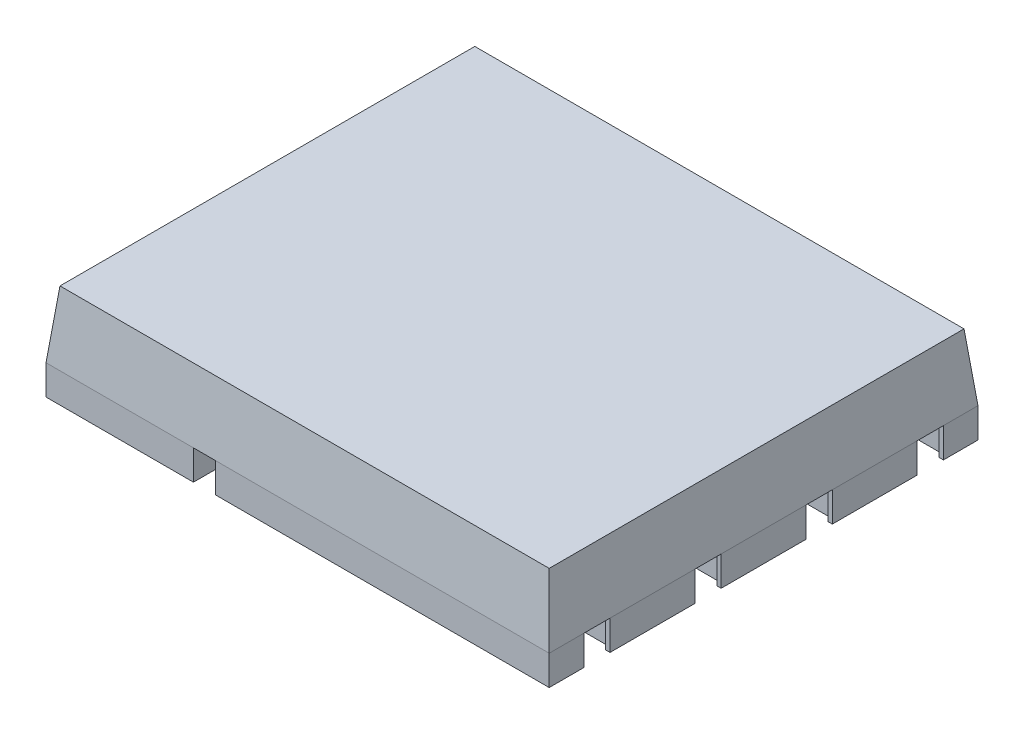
ISO-10303-21;
HEADER;
FILE_DESCRIPTION(('STEP AP214'),'2;1');
FILE_NAME('part.step','',(''),(''),'','','');
FILE_SCHEMA(('AUTOMOTIVE_DESIGN { 1 0 10303 214 1 1 1 1 }'));
ENDSEC;
DATA;
#1=APPLICATION_CONTEXT('core data for automotive mechanical design processes');
#2=APPLICATION_PROTOCOL_DEFINITION('international standard','automotive_design',2000,#1);
#3=PRODUCT_CONTEXT('',#1,'mechanical');
#4=PRODUCT('Part','Part','',(#3));
#5=PRODUCT_RELATED_PRODUCT_CATEGORY('part','',(#4));
#6=PRODUCT_DEFINITION_FORMATION('','',#4);
#7=PRODUCT_DEFINITION_CONTEXT('part definition',#1,'design');
#8=PRODUCT_DEFINITION('design','',#6,#7);
#9=PRODUCT_DEFINITION_SHAPE('','',#8);
#10=(LENGTH_UNIT() NAMED_UNIT(*) SI_UNIT(.MILLI.,.METRE.));
#11=(NAMED_UNIT(*) PLANE_ANGLE_UNIT() SI_UNIT($,.RADIAN.));
#12=(NAMED_UNIT(*) SI_UNIT($,.STERADIAN.) SOLID_ANGLE_UNIT());
#13=UNCERTAINTY_MEASURE_WITH_UNIT(LENGTH_MEASURE(1.E-05),#10,'distance_accuracy_value','');
#14=(GEOMETRIC_REPRESENTATION_CONTEXT(3) GLOBAL_UNCERTAINTY_ASSIGNED_CONTEXT((#13)) GLOBAL_UNIT_ASSIGNED_CONTEXT((#10,
#11,#12)) REPRESENTATION_CONTEXT('',''));
#15=CARTESIAN_POINT('',(0.,0.,0.));
#16=DIRECTION('',(0.,0.,1.));
#17=DIRECTION('',(1.,0.,0.));
#18=AXIS2_PLACEMENT_3D('',#15,#16,#17);
#19=CARTESIAN_POINT('',(0.,0.,0.));
#20=DIRECTION('',(0.,1.,0.));
#21=DIRECTION('',(0.,0.,1.));
#22=AXIS2_PLACEMENT_3D('',#19,#20,#21);
#23=PLANE('',#22);
#24=DIRECTION('',(0.,0.,1.));
#25=VECTOR('',#24,1.);
#26=CARTESIAN_POINT('',(-1.19,0.,0.));
#27=LINE('',#26,#25);
#28=CARTESIAN_POINT('',(-1.19,0.,-2.11));
#29=VERTEX_POINT('',#28);
#30=CARTESIAN_POINT('',(-1.19,0.,-2.45));
#31=VERTEX_POINT('',#30);
#32=EDGE_CURVE('E582',#29,#31,#27,.F.);
#33=ORIENTED_EDGE('',*,*,#32,.F.);
#34=DIRECTION('',(1.,0.,0.));
#35=VECTOR('',#34,1.);
#36=CARTESIAN_POINT('',(0.,0.,-2.11));
#37=LINE('',#36,#35);
#38=CARTESIAN_POINT('',(-1.29,0.,-2.11));
#39=VERTEX_POINT('',#38);
#40=EDGE_CURVE('E587',#39,#29,#37,.T.);
#41=ORIENTED_EDGE('',*,*,#40,.F.);
#42=DIRECTION('',(0.,0.,1.));
#43=VECTOR('',#42,1.);
#44=CARTESIAN_POINT('',(-1.29,0.,0.));
#45=LINE('',#44,#43);
#46=CARTESIAN_POINT('',(-1.29,0.,2.11));
#47=VERTEX_POINT('',#46);
#48=EDGE_CURVE('E585',#39,#47,#45,.T.);
#49=ORIENTED_EDGE('',*,*,#48,.T.);
#50=DIRECTION('',(1.,0.,0.));
#51=VECTOR('',#50,1.);
#52=CARTESIAN_POINT('',(0.,0.,2.11));
#53=LINE('',#52,#51);
#54=CARTESIAN_POINT('',(-1.19,0.,2.11));
#55=VERTEX_POINT('',#54);
#56=EDGE_CURVE('E593',#55,#47,#53,.F.);
#57=ORIENTED_EDGE('',*,*,#56,.F.);
#58=DIRECTION('',(0.,0.,1.));
#59=VECTOR('',#58,1.);
#60=CARTESIAN_POINT('',(-1.19,0.,0.));
#61=LINE('',#60,#59);
#62=CARTESIAN_POINT('',(-1.19,0.,2.45));
#63=VERTEX_POINT('',#62);
#64=EDGE_CURVE('E595',#63,#55,#61,.F.);
#65=ORIENTED_EDGE('',*,*,#64,.F.);
#66=DIRECTION('',(1.,0.,0.));
#67=VECTOR('',#66,1.);
#68=CARTESIAN_POINT('',(0.,0.,2.45));
#69=LINE('',#68,#67);
#70=CARTESIAN_POINT('',(-2.875,0.,2.45));
#71=VERTEX_POINT('',#70);
#72=EDGE_CURVE('E598',#71,#63,#69,.T.);
#73=ORIENTED_EDGE('',*,*,#72,.F.);
#74=DIRECTION('',(0.,0.,1.));
#75=VECTOR('',#74,1.);
#76=CARTESIAN_POINT('',(-2.875,0.,0.));
#77=LINE('',#76,#75);
#78=CARTESIAN_POINT('',(-2.875,0.,2.055));
#79=VERTEX_POINT('',#78);
#80=EDGE_CURVE('E601',#79,#71,#77,.T.);
#81=ORIENTED_EDGE('',*,*,#80,.F.);
#82=DIRECTION('',(1.,0.,0.));
#83=VECTOR('',#82,1.);
#84=CARTESIAN_POINT('',(0.,0.,2.055));
#85=LINE('',#84,#83);
#86=CARTESIAN_POINT('',(-2.825,0.,2.055));
#87=VERTEX_POINT('',#86);
#88=EDGE_CURVE('E604',#87,#79,#85,.F.);
#89=ORIENTED_EDGE('',*,*,#88,.F.);
#90=DIRECTION('',(-0.707106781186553,0.,-0.707106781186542));
#91=VECTOR('',#90,1.);
#92=CARTESIAN_POINT('',(-2.77,0.,2.11));
#93=LINE('',#92,#91);
#94=CARTESIAN_POINT('',(-2.77,0.,2.11));
#95=VERTEX_POINT('',#94);
#96=EDGE_CURVE('E607',#95,#87,#93,.T.);
#97=ORIENTED_EDGE('',*,*,#96,.F.);
#98=DIRECTION('',(1.,0.,0.));
#99=VECTOR('',#98,1.);
#100=CARTESIAN_POINT('',(0.,0.,2.11));
#101=LINE('',#100,#99);
#102=CARTESIAN_POINT('',(-2.39,0.,2.11));
#103=VERTEX_POINT('',#102);
#104=EDGE_CURVE('E610',#103,#95,#101,.F.);
#105=ORIENTED_EDGE('',*,*,#104,.F.);
#106=DIRECTION('',(0.,0.,1.));
#107=VECTOR('',#106,1.);
#108=CARTESIAN_POINT('',(-2.39,0.,0.));
#109=LINE('',#108,#107);
#110=CARTESIAN_POINT('',(-2.39,0.,1.7));
#111=VERTEX_POINT('',#110);
#112=EDGE_CURVE('E613',#111,#103,#109,.T.);
#113=ORIENTED_EDGE('',*,*,#112,.F.);
#114=DIRECTION('',(1.,0.,0.));
#115=VECTOR('',#114,1.);
#116=CARTESIAN_POINT('',(0.,0.,1.7));
#117=LINE('',#116,#115);
#118=CARTESIAN_POINT('',(-2.77,0.,1.7));
#119=VERTEX_POINT('',#118);
#120=EDGE_CURVE('E616',#119,#111,#117,.T.);
#121=ORIENTED_EDGE('',*,*,#120,.F.);
#122=DIRECTION('',(0.70710678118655,0.,-0.707106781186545));
#123=VECTOR('',#122,1.);
#124=CARTESIAN_POINT('',(-2.825,0.,1.755));
#125=LINE('',#124,#123);
#126=CARTESIAN_POINT('',(-2.825,0.,1.755));
#127=VERTEX_POINT('',#126);
#128=EDGE_CURVE('E619',#127,#119,#125,.T.);
#129=ORIENTED_EDGE('',*,*,#128,.F.);
#130=DIRECTION('',(1.,0.,0.));
#131=VECTOR('',#130,1.);
#132=CARTESIAN_POINT('',(0.,0.,1.755));
#133=LINE('',#132,#131);
#134=CARTESIAN_POINT('',(-2.875,0.,1.755));
#135=VERTEX_POINT('',#134);
#136=EDGE_CURVE('E622',#135,#127,#133,.T.);
#137=ORIENTED_EDGE('',*,*,#136,.F.);
#138=DIRECTION('',(0.,0.,1.));
#139=VECTOR('',#138,1.);
#140=CARTESIAN_POINT('',(-2.875,0.,0.));
#141=LINE('',#140,#139);
#142=CARTESIAN_POINT('',(-2.875,0.,0.785000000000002));
#143=VERTEX_POINT('',#142);
#144=EDGE_CURVE('E625',#143,#135,#141,.T.);
#145=ORIENTED_EDGE('',*,*,#144,.F.);
#146=DIRECTION('',(1.,0.,0.));
#147=VECTOR('',#146,1.);
#148=CARTESIAN_POINT('',(0.,0.,0.785));
#149=LINE('',#148,#147);
#150=CARTESIAN_POINT('',(-2.825,0.,0.785000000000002));
#151=VERTEX_POINT('',#150);
#152=EDGE_CURVE('E628',#151,#143,#149,.F.);
#153=ORIENTED_EDGE('',*,*,#152,.F.);
#154=DIRECTION('',(-0.70710678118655,0.,-0.707106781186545));
#155=VECTOR('',#154,1.);
#156=CARTESIAN_POINT('',(-2.77,0.,0.84));
#157=LINE('',#156,#155);
#158=CARTESIAN_POINT('',(-2.77,0.,0.84));
#159=VERTEX_POINT('',#158);
#160=EDGE_CURVE('E631',#159,#151,#157,.T.);
#161=ORIENTED_EDGE('',*,*,#160,.F.);
#162=DIRECTION('',(1.,0.,0.));
#163=VECTOR('',#162,1.);
#164=CARTESIAN_POINT('',(0.,0.,0.84));
#165=LINE('',#164,#163);
#166=CARTESIAN_POINT('',(-2.39,0.,0.84));
#167=VERTEX_POINT('',#166);
#168=EDGE_CURVE('E634',#167,#159,#165,.F.);
#169=ORIENTED_EDGE('',*,*,#168,.F.);
#170=DIRECTION('',(0.,0.,1.));
#171=VECTOR('',#170,1.);
#172=CARTESIAN_POINT('',(-2.39,0.,0.));
#173=LINE('',#172,#171);
#174=CARTESIAN_POINT('',(-2.39,0.,0.430000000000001));
#175=VERTEX_POINT('',#174);
#176=EDGE_CURVE('E637',#175,#167,#173,.T.);
#177=ORIENTED_EDGE('',*,*,#176,.F.);
#178=DIRECTION('',(1.,0.,0.));
#179=VECTOR('',#178,1.);
#180=CARTESIAN_POINT('',(0.,0.,0.43));
#181=LINE('',#180,#179);
#182=CARTESIAN_POINT('',(-2.77,0.,0.430000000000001));
#183=VERTEX_POINT('',#182);
#184=EDGE_CURVE('E640',#183,#175,#181,.T.);
#185=ORIENTED_EDGE('',*,*,#184,.F.);
#186=DIRECTION('',(0.70710678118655,0.,-0.707106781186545));
#187=VECTOR('',#186,1.);
#188=CARTESIAN_POINT('',(-2.825,0.,0.485));
#189=LINE('',#188,#187);
#190=CARTESIAN_POINT('',(-2.825,0.,0.485000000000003));
#191=VERTEX_POINT('',#190);
#192=EDGE_CURVE('E643',#191,#183,#189,.T.);
#193=ORIENTED_EDGE('',*,*,#192,.F.);
#194=DIRECTION('',(1.,0.,0.));
#195=VECTOR('',#194,1.);
#196=CARTESIAN_POINT('',(0.,0.,0.485));
#197=LINE('',#196,#195);
#198=CARTESIAN_POINT('',(-2.875,0.,0.485000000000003));
#199=VERTEX_POINT('',#198);
#200=EDGE_CURVE('E646',#199,#191,#197,.T.);
#201=ORIENTED_EDGE('',*,*,#200,.F.);
#202=DIRECTION('',(0.,0.,1.));
#203=VECTOR('',#202,1.);
#204=CARTESIAN_POINT('',(-2.875,0.,0.));
#205=LINE('',#204,#203);
#206=CARTESIAN_POINT('',(-2.875,0.,-0.484999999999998));
#207=VERTEX_POINT('',#206);
#208=EDGE_CURVE('E649',#207,#199,#205,.T.);
#209=ORIENTED_EDGE('',*,*,#208,.F.);
#210=DIRECTION('',(1.,0.,0.));
#211=VECTOR('',#210,1.);
#212=CARTESIAN_POINT('',(0.,0.,-0.485));
#213=LINE('',#212,#211);
#214=CARTESIAN_POINT('',(-2.825,0.,-0.484999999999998));
#215=VERTEX_POINT('',#214);
#216=EDGE_CURVE('E652',#215,#207,#213,.F.);
#217=ORIENTED_EDGE('',*,*,#216,.F.);
#218=DIRECTION('',(-0.70710678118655,0.,-0.707106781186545));
#219=VECTOR('',#218,1.);
#220=CARTESIAN_POINT('',(-2.77,0.,-0.43));
#221=LINE('',#220,#219);
#222=CARTESIAN_POINT('',(-2.77,0.,-0.43));
#223=VERTEX_POINT('',#222);
#224=EDGE_CURVE('E655',#223,#215,#221,.T.);
#225=ORIENTED_EDGE('',*,*,#224,.F.);
#226=DIRECTION('',(1.,0.,0.));
#227=VECTOR('',#226,1.);
#228=CARTESIAN_POINT('',(0.,0.,-0.43));
#229=LINE('',#228,#227);
#230=CARTESIAN_POINT('',(-2.39,0.,-0.43));
#231=VERTEX_POINT('',#230);
#232=EDGE_CURVE('E658',#231,#223,#229,.F.);
#233=ORIENTED_EDGE('',*,*,#232,.F.);
#234=DIRECTION('',(0.,0.,1.));
#235=VECTOR('',#234,1.);
#236=CARTESIAN_POINT('',(-2.39,0.,0.));
#237=LINE('',#236,#235);
#238=CARTESIAN_POINT('',(-2.39,0.,-0.839999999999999));
#239=VERTEX_POINT('',#238);
#240=EDGE_CURVE('E661',#239,#231,#237,.T.);
#241=ORIENTED_EDGE('',*,*,#240,.F.);
#242=DIRECTION('',(1.,0.,0.));
#243=VECTOR('',#242,1.);
#244=CARTESIAN_POINT('',(0.,0.,-0.84));
#245=LINE('',#244,#243);
#246=CARTESIAN_POINT('',(-2.77,0.,-0.839999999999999));
#247=VERTEX_POINT('',#246);
#248=EDGE_CURVE('E664',#247,#239,#245,.T.);
#249=ORIENTED_EDGE('',*,*,#248,.F.);
#250=DIRECTION('',(0.70710678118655,0.,-0.707106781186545));
#251=VECTOR('',#250,1.);
#252=CARTESIAN_POINT('',(-2.825,0.,-0.785));
#253=LINE('',#252,#251);
#254=CARTESIAN_POINT('',(-2.825,0.,-0.784999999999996));
#255=VERTEX_POINT('',#254);
#256=EDGE_CURVE('E667',#255,#247,#253,.T.);
#257=ORIENTED_EDGE('',*,*,#256,.F.);
#258=DIRECTION('',(1.,0.,0.));
#259=VECTOR('',#258,1.);
#260=CARTESIAN_POINT('',(0.,0.,-0.785));
#261=LINE('',#260,#259);
#262=CARTESIAN_POINT('',(-2.875,0.,-0.784999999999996));
#263=VERTEX_POINT('',#262);
#264=EDGE_CURVE('E670',#263,#255,#261,.T.);
#265=ORIENTED_EDGE('',*,*,#264,.F.);
#266=DIRECTION('',(0.,0.,1.));
#267=VECTOR('',#266,1.);
#268=CARTESIAN_POINT('',(-2.875,0.,0.));
#269=LINE('',#268,#267);
#270=CARTESIAN_POINT('',(-2.875,0.,-1.755));
#271=VERTEX_POINT('',#270);
#272=EDGE_CURVE('E673',#271,#263,#269,.T.);
#273=ORIENTED_EDGE('',*,*,#272,.F.);
#274=DIRECTION('',(1.,0.,0.));
#275=VECTOR('',#274,1.);
#276=CARTESIAN_POINT('',(0.,0.,-1.755));
#277=LINE('',#276,#275);
#278=CARTESIAN_POINT('',(-2.825,0.,-1.755));
#279=VERTEX_POINT('',#278);
#280=EDGE_CURVE('E676',#279,#271,#277,.F.);
#281=ORIENTED_EDGE('',*,*,#280,.F.);
#282=DIRECTION('',(-0.70710678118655,0.,-0.707106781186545));
#283=VECTOR('',#282,1.);
#284=CARTESIAN_POINT('',(-2.77,0.,-1.7));
#285=LINE('',#284,#283);
#286=CARTESIAN_POINT('',(-2.77,0.,-1.7));
#287=VERTEX_POINT('',#286);
#288=EDGE_CURVE('E679',#287,#279,#285,.T.);
#289=ORIENTED_EDGE('',*,*,#288,.F.);
#290=DIRECTION('',(1.,0.,0.));
#291=VECTOR('',#290,1.);
#292=CARTESIAN_POINT('',(0.,0.,-1.7));
#293=LINE('',#292,#291);
#294=CARTESIAN_POINT('',(-2.39,0.,-1.7));
#295=VERTEX_POINT('',#294);
#296=EDGE_CURVE('E682',#295,#287,#293,.F.);
#297=ORIENTED_EDGE('',*,*,#296,.F.);
#298=DIRECTION('',(0.,0.,1.));
#299=VECTOR('',#298,1.);
#300=CARTESIAN_POINT('',(-2.39,0.,0.));
#301=LINE('',#300,#299);
#302=CARTESIAN_POINT('',(-2.39,0.,-2.11));
#303=VERTEX_POINT('',#302);
#304=EDGE_CURVE('E685',#303,#295,#301,.T.);
#305=ORIENTED_EDGE('',*,*,#304,.F.);
#306=DIRECTION('',(1.,0.,0.));
#307=VECTOR('',#306,1.);
#308=CARTESIAN_POINT('',(0.,0.,-2.11));
#309=LINE('',#308,#307);
#310=CARTESIAN_POINT('',(-2.77,0.,-2.11));
#311=VERTEX_POINT('',#310);
#312=EDGE_CURVE('E688',#311,#303,#309,.T.);
#313=ORIENTED_EDGE('',*,*,#312,.F.);
#314=DIRECTION('',(0.707106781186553,0.,-0.707106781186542));
#315=VECTOR('',#314,1.);
#316=CARTESIAN_POINT('',(-2.825,0.,-2.055));
#317=LINE('',#316,#315);
#318=CARTESIAN_POINT('',(-2.825,0.,-2.055));
#319=VERTEX_POINT('',#318);
#320=EDGE_CURVE('E552',#319,#311,#317,.T.);
#321=ORIENTED_EDGE('',*,*,#320,.F.);
#322=DIRECTION('',(1.,0.,0.));
#323=VECTOR('',#322,1.);
#324=CARTESIAN_POINT('',(0.,0.,-2.055));
#325=LINE('',#324,#323);
#326=CARTESIAN_POINT('',(-2.875,0.,-2.055));
#327=VERTEX_POINT('',#326);
#328=EDGE_CURVE('E549',#327,#319,#325,.T.);
#329=ORIENTED_EDGE('',*,*,#328,.F.);
#330=DIRECTION('',(0.,0.,1.));
#331=VECTOR('',#330,1.);
#332=CARTESIAN_POINT('',(-2.875,0.,0.));
#333=LINE('',#332,#331);
#334=CARTESIAN_POINT('',(-2.875,0.,-2.45));
#335=VERTEX_POINT('',#334);
#336=EDGE_CURVE('E20',#335,#327,#333,.T.);
#337=ORIENTED_EDGE('',*,*,#336,.F.);
#338=DIRECTION('',(1.,0.,0.));
#339=VECTOR('',#338,1.);
#340=CARTESIAN_POINT('',(0.,0.,-2.45));
#341=LINE('',#340,#339);
#342=EDGE_CURVE('E576',#31,#335,#341,.F.);
#343=ORIENTED_EDGE('',*,*,#342,.F.);
#344=EDGE_LOOP('',(#33,#41,#49,#57,#65,#73,#81,#89,#97,#105,#113,#121,#129,#137,#145,#153,#161,
#169,#177,#185,#193,#201,#209,#217,#225,#233,#241,#249,#257,#265,#273,#281,#289,#297,#305,#313,
#321,#329,#337,#343));
#345=FACE_BOUND('',#344,.T.);
#346=ADVANCED_FACE('F17',(#345),#23,.F.);
#347=CARTESIAN_POINT('',(-1.29,7.110958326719,0.));
#348=DIRECTION('',(-1.,0.,0.));
#349=DIRECTION('',(0.,0.,1.));
#350=AXIS2_PLACEMENT_3D('',#347,#348,#349);
#351=PLANE('',#350);
#352=ORIENTED_EDGE('',*,*,#48,.F.);
#353=DIRECTION('',(0.,1.,0.));
#354=VECTOR('',#353,1.);
#355=CARTESIAN_POINT('',(-1.29,7.110958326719,-2.11));
#356=LINE('',#355,#354);
#357=CARTESIAN_POINT('',(-1.29,0.34,-2.11));
#358=VERTEX_POINT('',#357);
#359=EDGE_CURVE('E581',#358,#39,#356,.F.);
#360=ORIENTED_EDGE('',*,*,#359,.F.);
#361=DIRECTION('',(0.,0.,1.));
#362=VECTOR('',#361,1.);
#363=CARTESIAN_POINT('',(-1.29,0.34,0.));
#364=LINE('',#363,#362);
#365=CARTESIAN_POINT('',(-1.29,0.34,2.11));
#366=VERTEX_POINT('',#365);
#367=EDGE_CURVE('E1021',#358,#366,#364,.T.);
#368=ORIENTED_EDGE('',*,*,#367,.T.);
#369=DIRECTION('',(0.,1.,0.));
#370=VECTOR('',#369,1.);
#371=CARTESIAN_POINT('',(-1.29,7.110958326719,2.11));
#372=LINE('',#371,#370);
#373=EDGE_CURVE('E1048',#47,#366,#372,.T.);
#374=ORIENTED_EDGE('',*,*,#373,.F.);
#375=EDGE_LOOP('',(#352,#360,#368,#374));
#376=FACE_BOUND('',#375,.T.);
#377=ADVANCED_FACE('F1054',(#376),#351,.F.);
#378=CARTESIAN_POINT('',(0.,0.34,0.));
#379=DIRECTION('',(0.,1.,0.));
#380=DIRECTION('',(0.,0.,1.));
#381=AXIS2_PLACEMENT_3D('',#378,#379,#380);
#382=PLANE('',#381);
#383=DIRECTION('',(-1.,0.,0.));
#384=VECTOR('',#383,1.);
#385=CARTESIAN_POINT('',(0.,0.34,-0.43));
#386=LINE('',#385,#384);
#387=CARTESIAN_POINT('',(2.44,0.34,-0.43));
#388=VERTEX_POINT('',#387);
#389=CARTESIAN_POINT('',(2.77,0.339999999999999,-0.429999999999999));
#390=VERTEX_POINT('',#389);
#391=EDGE_CURVE('E934',#388,#390,#386,.F.);
#392=ORIENTED_EDGE('',*,*,#391,.F.);
#393=DIRECTION('',(0.,0.,1.));
#394=VECTOR('',#393,1.);
#395=CARTESIAN_POINT('',(2.44,0.34,0.));
#396=LINE('',#395,#394);
#397=CARTESIAN_POINT('',(2.44,0.34,0.43));
#398=VERTEX_POINT('',#397);
#399=EDGE_CURVE('E930',#398,#388,#396,.F.);
#400=ORIENTED_EDGE('',*,*,#399,.F.);
#401=DIRECTION('',(-1.,0.,0.));
#402=VECTOR('',#401,1.);
#403=CARTESIAN_POINT('',(0.,0.34,0.43));
#404=LINE('',#403,#402);
#405=CARTESIAN_POINT('',(2.77,0.339999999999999,0.429999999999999));
#406=VERTEX_POINT('',#405);
#407=EDGE_CURVE('E925',#398,#406,#404,.F.);
#408=ORIENTED_EDGE('',*,*,#407,.T.);
#409=DIRECTION('',(-0.707106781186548,0.,-0.707106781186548));
#410=VECTOR('',#409,1.);
#411=CARTESIAN_POINT('',(1.17,0.339999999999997,-1.17));
#412=LINE('',#411,#410);
#413=CARTESIAN_POINT('',(2.825,0.339999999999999,0.484999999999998));
#414=VERTEX_POINT('',#413);
#415=EDGE_CURVE('E919',#406,#414,#412,.F.);
#416=ORIENTED_EDGE('',*,*,#415,.T.);
#417=DIRECTION('',(1.,0.,0.));
#418=VECTOR('',#417,1.);
#419=CARTESIAN_POINT('',(0.,0.34,0.485));
#420=LINE('',#419,#418);
#421=CARTESIAN_POINT('',(2.87500000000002,0.340000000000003,0.484999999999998));
#422=VERTEX_POINT('',#421);
#423=EDGE_CURVE('E988',#422,#414,#420,.F.);
#424=ORIENTED_EDGE('',*,*,#423,.F.);
#425=DIRECTION('',(0.,0.,1.));
#426=VECTOR('',#425,1.);
#427=CARTESIAN_POINT('',(2.875,0.34,0.));
#428=LINE('',#427,#426);
#429=CARTESIAN_POINT('',(2.87500000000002,0.340000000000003,0.784999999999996));
#430=VERTEX_POINT('',#429);
#431=EDGE_CURVE('E990',#430,#422,#428,.F.);
#432=ORIENTED_EDGE('',*,*,#431,.F.);
#433=DIRECTION('',(1.,0.,0.));
#434=VECTOR('',#433,1.);
#435=CARTESIAN_POINT('',(0.,0.34,0.785));
#436=LINE('',#435,#434);
#437=CARTESIAN_POINT('',(2.825,0.339999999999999,0.784999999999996));
#438=VERTEX_POINT('',#437);
#439=EDGE_CURVE('E993',#438,#430,#436,.T.);
#440=ORIENTED_EDGE('',*,*,#439,.F.);
#441=DIRECTION('',(-0.707106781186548,0.,0.707106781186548));
#442=VECTOR('',#441,1.);
#443=CARTESIAN_POINT('',(1.805,0.339999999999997,1.805));
#444=LINE('',#443,#442);
#445=CARTESIAN_POINT('',(2.77,0.339999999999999,0.840000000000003));
#446=VERTEX_POINT('',#445);
#447=EDGE_CURVE('E959',#446,#438,#444,.F.);
#448=ORIENTED_EDGE('',*,*,#447,.F.);
#449=DIRECTION('',(-1.,0.,0.));
#450=VECTOR('',#449,1.);
#451=CARTESIAN_POINT('',(0.,0.34,0.84));
#452=LINE('',#451,#450);
#453=CARTESIAN_POINT('',(2.44,0.34,0.840000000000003));
#454=VERTEX_POINT('',#453);
#455=EDGE_CURVE('E957',#454,#446,#452,.F.);
#456=ORIENTED_EDGE('',*,*,#455,.F.);
#457=DIRECTION('',(0.,0.,1.));
#458=VECTOR('',#457,1.);
#459=CARTESIAN_POINT('',(2.44,0.34,0.));
#460=LINE('',#459,#458);
#461=CARTESIAN_POINT('',(2.43999999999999,0.34,1.7));
#462=VERTEX_POINT('',#461);
#463=EDGE_CURVE('E953',#462,#454,#460,.F.);
#464=ORIENTED_EDGE('',*,*,#463,.F.);
#465=DIRECTION('',(-1.,0.,0.));
#466=VECTOR('',#465,1.);
#467=CARTESIAN_POINT('',(0.,0.34,1.7));
#468=LINE('',#467,#466);
#469=CARTESIAN_POINT('',(2.77,0.339999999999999,1.7));
#470=VERTEX_POINT('',#469);
#471=EDGE_CURVE('E948',#462,#470,#468,.F.);
#472=ORIENTED_EDGE('',*,*,#471,.T.);
#473=DIRECTION('',(-0.707106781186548,0.,-0.707106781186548));
#474=VECTOR('',#473,1.);
#475=CARTESIAN_POINT('',(0.535,0.339999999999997,-0.535));
#476=LINE('',#475,#474);
#477=CARTESIAN_POINT('',(2.825,0.339999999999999,1.755));
#478=VERTEX_POINT('',#477);
#479=EDGE_CURVE('E942',#470,#478,#476,.F.);
#480=ORIENTED_EDGE('',*,*,#479,.T.);
#481=DIRECTION('',(1.,0.,0.));
#482=VECTOR('',#481,1.);
#483=CARTESIAN_POINT('',(0.,0.34,1.755));
#484=LINE('',#483,#482);
#485=CARTESIAN_POINT('',(2.87500000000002,0.340000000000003,1.755));
#486=VERTEX_POINT('',#485);
#487=EDGE_CURVE('E996',#486,#478,#484,.F.);
#488=ORIENTED_EDGE('',*,*,#487,.F.);
#489=DIRECTION('',(0.,0.,1.));
#490=VECTOR('',#489,1.);
#491=CARTESIAN_POINT('',(2.875,0.34,0.));
#492=LINE('',#491,#490);
#493=CARTESIAN_POINT('',(2.87500000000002,0.340000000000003,2.055));
#494=VERTEX_POINT('',#493);
#495=EDGE_CURVE('E998',#494,#486,#492,.F.);
#496=ORIENTED_EDGE('',*,*,#495,.F.);
#497=DIRECTION('',(1.,0.,0.));
#498=VECTOR('',#497,1.);
#499=CARTESIAN_POINT('',(0.,0.34,2.055));
#500=LINE('',#499,#498);
#501=CARTESIAN_POINT('',(2.825,0.339999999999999,2.055));
#502=VERTEX_POINT('',#501);
#503=EDGE_CURVE('E1001',#502,#494,#500,.T.);
#504=ORIENTED_EDGE('',*,*,#503,.F.);
#505=DIRECTION('',(0.707106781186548,0.,-0.707106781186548));
#506=VECTOR('',#505,1.);
#507=CARTESIAN_POINT('',(2.44,0.339999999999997,2.44));
#508=LINE('',#507,#506);
#509=CARTESIAN_POINT('',(2.77,0.339999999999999,2.11));
#510=VERTEX_POINT('',#509);
#511=EDGE_CURVE('E884',#502,#510,#508,.F.);
#512=ORIENTED_EDGE('',*,*,#511,.T.);
#513=DIRECTION('',(1.,0.,0.));
#514=VECTOR('',#513,1.);
#515=CARTESIAN_POINT('',(0.,0.34,2.11));
#516=LINE('',#515,#514);
#517=CARTESIAN_POINT('',(2.21,0.34,2.11));
#518=VERTEX_POINT('',#517);
#519=EDGE_CURVE('E881',#510,#518,#516,.F.);
#520=ORIENTED_EDGE('',*,*,#519,.T.);
#521=DIRECTION('',(0.,0.,1.));
#522=VECTOR('',#521,1.);
#523=CARTESIAN_POINT('',(2.21,0.34,0.));
#524=LINE('',#523,#522);
#525=CARTESIAN_POINT('',(2.21,0.34,1.905));
#526=VERTEX_POINT('',#525);
#527=EDGE_CURVE('E875',#518,#526,#524,.F.);
#528=ORIENTED_EDGE('',*,*,#527,.T.);
#529=DIRECTION('',(-1.,0.,0.));
#530=VECTOR('',#529,1.);
#531=CARTESIAN_POINT('',(0.,0.34,1.905));
#532=LINE('',#531,#530);
#533=CARTESIAN_POINT('',(-0.919999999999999,0.34,1.905));
#534=VERTEX_POINT('',#533);
#535=EDGE_CURVE('E870',#534,#526,#532,.F.);
#536=ORIENTED_EDGE('',*,*,#535,.F.);
#537=DIRECTION('',(0.,0.,1.));
#538=VECTOR('',#537,1.);
#539=CARTESIAN_POINT('',(-0.92,0.34,0.));
#540=LINE('',#539,#538);
#541=CARTESIAN_POINT('',(-0.919999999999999,0.34,2.11));
#542=VERTEX_POINT('',#541);
#543=EDGE_CURVE('E1004',#542,#534,#540,.F.);
#544=ORIENTED_EDGE('',*,*,#543,.F.);
#545=DIRECTION('',(1.,0.,0.));
#546=VECTOR('',#545,1.);
#547=CARTESIAN_POINT('',(0.,0.34,2.11));
#548=LINE('',#547,#546);
#549=CARTESIAN_POINT('',(-0.94,0.34,2.11));
#550=VERTEX_POINT('',#549);
#551=EDGE_CURVE('E1006',#550,#542,#548,.T.);
#552=ORIENTED_EDGE('',*,*,#551,.F.);
#553=DIRECTION('',(0.,0.,1.));
#554=VECTOR('',#553,1.);
#555=CARTESIAN_POINT('',(-0.94,0.34,0.));
#556=LINE('',#555,#554);
#557=CARTESIAN_POINT('',(-0.94,0.340000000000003,2.45000000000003));
#558=VERTEX_POINT('',#557);
#559=EDGE_CURVE('E1009',#558,#550,#556,.F.);
#560=ORIENTED_EDGE('',*,*,#559,.F.);
#561=DIRECTION('',(1.,0.,0.));
#562=VECTOR('',#561,1.);
#563=CARTESIAN_POINT('',(0.,0.34,2.45));
#564=LINE('',#563,#562);
#565=CARTESIAN_POINT('',(-1.19,0.340000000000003,2.45000000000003));
#566=VERTEX_POINT('',#565);
#567=EDGE_CURVE('E1012',#566,#558,#564,.T.);
#568=ORIENTED_EDGE('',*,*,#567,.F.);
#569=DIRECTION('',(0.,0.,1.));
#570=VECTOR('',#569,1.);
#571=CARTESIAN_POINT('',(-1.19,0.34,0.));
#572=LINE('',#571,#570);
#573=CARTESIAN_POINT('',(-1.19,0.34,2.11));
#574=VERTEX_POINT('',#573);
#575=EDGE_CURVE('E1015',#574,#566,#572,.T.);
#576=ORIENTED_EDGE('',*,*,#575,.F.);
#577=DIRECTION('',(1.,0.,0.));
#578=VECTOR('',#577,1.);
#579=CARTESIAN_POINT('',(0.,0.34,2.11));
#580=LINE('',#579,#578);
#581=EDGE_CURVE('E1018',#366,#574,#580,.T.);
#582=ORIENTED_EDGE('',*,*,#581,.F.);
#583=ORIENTED_EDGE('',*,*,#367,.F.);
#584=DIRECTION('',(-1.,0.,0.));
#585=VECTOR('',#584,1.);
#586=CARTESIAN_POINT('',(0.,0.34,-2.11));
#587=LINE('',#586,#585);
#588=CARTESIAN_POINT('',(-1.19,0.34,-2.11));
#589=VERTEX_POINT('',#588);
#590=EDGE_CURVE('E985',#358,#589,#587,.F.);
#591=ORIENTED_EDGE('',*,*,#590,.T.);
#592=DIRECTION('',(0.,0.,1.));
#593=VECTOR('',#592,1.);
#594=CARTESIAN_POINT('',(-1.19,0.34,0.));
#595=LINE('',#594,#593);
#596=CARTESIAN_POINT('',(-1.19,0.340000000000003,-2.45000000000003));
#597=VERTEX_POINT('',#596);
#598=EDGE_CURVE('E1024',#597,#589,#595,.T.);
#599=ORIENTED_EDGE('',*,*,#598,.F.);
#600=DIRECTION('',(1.,0.,0.));
#601=VECTOR('',#600,1.);
#602=CARTESIAN_POINT('',(0.,0.34,-2.45));
#603=LINE('',#602,#601);
#604=CARTESIAN_POINT('',(-0.94,0.340000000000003,-2.45000000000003));
#605=VERTEX_POINT('',#604);
#606=EDGE_CURVE('E1026',#605,#597,#603,.F.);
#607=ORIENTED_EDGE('',*,*,#606,.F.);
#608=DIRECTION('',(0.,0.,1.));
#609=VECTOR('',#608,1.);
#610=CARTESIAN_POINT('',(-0.94,0.34,0.));
#611=LINE('',#610,#609);
#612=CARTESIAN_POINT('',(-0.94,0.34,-2.11));
#613=VERTEX_POINT('',#612);
#614=EDGE_CURVE('E1029',#613,#605,#611,.F.);
#615=ORIENTED_EDGE('',*,*,#614,.F.);
#616=DIRECTION('',(-1.,0.,0.));
#617=VECTOR('',#616,1.);
#618=CARTESIAN_POINT('',(0.,0.34,-2.11));
#619=LINE('',#618,#617);
#620=CARTESIAN_POINT('',(-0.919999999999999,0.34,-2.11));
#621=VERTEX_POINT('',#620);
#622=EDGE_CURVE('E982',#613,#621,#619,.F.);
#623=ORIENTED_EDGE('',*,*,#622,.T.);
#624=DIRECTION('',(0.,0.,-1.));
#625=VECTOR('',#624,1.);
#626=CARTESIAN_POINT('',(-0.92,0.34,0.));
#627=LINE('',#626,#625);
#628=CARTESIAN_POINT('',(-0.919999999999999,0.34,-1.905));
#629=VERTEX_POINT('',#628);
#630=EDGE_CURVE('E979',#621,#629,#627,.F.);
#631=ORIENTED_EDGE('',*,*,#630,.T.);
#632=DIRECTION('',(-1.,0.,0.));
#633=VECTOR('',#632,1.);
#634=CARTESIAN_POINT('',(0.,0.34,-1.905));
#635=LINE('',#634,#633);
#636=CARTESIAN_POINT('',(2.21,0.34,-1.905));
#637=VERTEX_POINT('',#636);
#638=EDGE_CURVE('E973',#629,#637,#635,.F.);
#639=ORIENTED_EDGE('',*,*,#638,.T.);
#640=DIRECTION('',(0.,0.,-1.));
#641=VECTOR('',#640,1.);
#642=CARTESIAN_POINT('',(2.21,0.34,0.));
#643=LINE('',#642,#641);
#644=CARTESIAN_POINT('',(2.21,0.34,-2.11));
#645=VERTEX_POINT('',#644);
#646=EDGE_CURVE('E968',#645,#637,#643,.F.);
#647=ORIENTED_EDGE('',*,*,#646,.F.);
#648=DIRECTION('',(1.,0.,0.));
#649=VECTOR('',#648,1.);
#650=CARTESIAN_POINT('',(0.,0.34,-2.11));
#651=LINE('',#650,#649);
#652=CARTESIAN_POINT('',(2.77,0.339999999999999,-2.11));
#653=VERTEX_POINT('',#652);
#654=EDGE_CURVE('E964',#653,#645,#651,.F.);
#655=ORIENTED_EDGE('',*,*,#654,.F.);
#656=DIRECTION('',(0.707106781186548,0.,0.707106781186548));
#657=VECTOR('',#656,1.);
#658=CARTESIAN_POINT('',(2.44,0.339999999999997,-2.44));
#659=LINE('',#658,#657);
#660=CARTESIAN_POINT('',(2.825,0.339999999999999,-2.055));
#661=VERTEX_POINT('',#660);
#662=EDGE_CURVE('E889',#661,#653,#659,.F.);
#663=ORIENTED_EDGE('',*,*,#662,.F.);
#664=DIRECTION('',(1.,0.,0.));
#665=VECTOR('',#664,1.);
#666=CARTESIAN_POINT('',(0.,0.34,-2.055));
#667=LINE('',#666,#665);
#668=CARTESIAN_POINT('',(2.87500000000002,0.340000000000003,-2.055));
#669=VERTEX_POINT('',#668);
#670=EDGE_CURVE('E1032',#669,#661,#667,.F.);
#671=ORIENTED_EDGE('',*,*,#670,.F.);
#672=DIRECTION('',(0.,0.,1.));
#673=VECTOR('',#672,1.);
#674=CARTESIAN_POINT('',(2.875,0.34,0.));
#675=LINE('',#674,#673);
#676=CARTESIAN_POINT('',(2.87500000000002,0.340000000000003,-1.755));
#677=VERTEX_POINT('',#676);
#678=EDGE_CURVE('E1034',#677,#669,#675,.F.);
#679=ORIENTED_EDGE('',*,*,#678,.F.);
#680=DIRECTION('',(1.,0.,0.));
#681=VECTOR('',#680,1.);
#682=CARTESIAN_POINT('',(0.,0.34,-1.755));
#683=LINE('',#682,#681);
#684=CARTESIAN_POINT('',(2.825,0.339999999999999,-1.755));
#685=VERTEX_POINT('',#684);
#686=EDGE_CURVE('E1037',#685,#677,#683,.T.);
#687=ORIENTED_EDGE('',*,*,#686,.F.);
#688=DIRECTION('',(-0.707106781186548,0.,0.707106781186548));
#689=VECTOR('',#688,1.);
#690=CARTESIAN_POINT('',(0.535,0.339999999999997,0.535));
#691=LINE('',#690,#689);
#692=CARTESIAN_POINT('',(2.77,0.339999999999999,-1.7));
#693=VERTEX_POINT('',#692);
#694=EDGE_CURVE('E913',#693,#685,#691,.F.);
#695=ORIENTED_EDGE('',*,*,#694,.F.);
#696=DIRECTION('',(-1.,0.,0.));
#697=VECTOR('',#696,1.);
#698=CARTESIAN_POINT('',(0.,0.34,-1.7));
#699=LINE('',#698,#697);
#700=CARTESIAN_POINT('',(2.43999999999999,0.34,-1.7));
#701=VERTEX_POINT('',#700);
#702=EDGE_CURVE('E911',#701,#693,#699,.F.);
#703=ORIENTED_EDGE('',*,*,#702,.F.);
#704=DIRECTION('',(0.,0.,-1.));
#705=VECTOR('',#704,1.);
#706=CARTESIAN_POINT('',(2.44,0.34,0.));
#707=LINE('',#706,#705);
#708=CARTESIAN_POINT('',(2.44,0.34,-0.840000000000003));
#709=VERTEX_POINT('',#708);
#710=EDGE_CURVE('E906',#701,#709,#707,.F.);
#711=ORIENTED_EDGE('',*,*,#710,.T.);
#712=DIRECTION('',(-1.,0.,0.));
#713=VECTOR('',#712,1.);
#714=CARTESIAN_POINT('',(0.,0.34,-0.84));
#715=LINE('',#714,#713);
#716=CARTESIAN_POINT('',(2.77,0.339999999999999,-0.840000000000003));
#717=VERTEX_POINT('',#716);
#718=EDGE_CURVE('E900',#709,#717,#715,.F.);
#719=ORIENTED_EDGE('',*,*,#718,.T.);
#720=DIRECTION('',(-0.707106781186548,0.,-0.707106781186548));
#721=VECTOR('',#720,1.);
#722=CARTESIAN_POINT('',(1.805,0.339999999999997,-1.805));
#723=LINE('',#722,#721);
#724=CARTESIAN_POINT('',(2.825,0.339999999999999,-0.784999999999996));
#725=VERTEX_POINT('',#724);
#726=EDGE_CURVE('E894',#717,#725,#723,.F.);
#727=ORIENTED_EDGE('',*,*,#726,.T.);
#728=DIRECTION('',(1.,0.,0.));
#729=VECTOR('',#728,1.);
#730=CARTESIAN_POINT('',(0.,0.34,-0.785));
#731=LINE('',#730,#729);
#732=CARTESIAN_POINT('',(2.87500000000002,0.340000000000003,-0.784999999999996));
#733=VERTEX_POINT('',#732);
#734=EDGE_CURVE('E1040',#733,#725,#731,.F.);
#735=ORIENTED_EDGE('',*,*,#734,.F.);
#736=DIRECTION('',(0.,0.,1.));
#737=VECTOR('',#736,1.);
#738=CARTESIAN_POINT('',(2.875,0.34,0.));
#739=LINE('',#738,#737);
#740=CARTESIAN_POINT('',(2.87500000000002,0.340000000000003,-0.484999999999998));
#741=VERTEX_POINT('',#740);
#742=EDGE_CURVE('E1042',#741,#733,#739,.F.);
#743=ORIENTED_EDGE('',*,*,#742,.F.);
#744=DIRECTION('',(1.,0.,0.));
#745=VECTOR('',#744,1.);
#746=CARTESIAN_POINT('',(0.,0.34,-0.485));
#747=LINE('',#746,#745);
#748=CARTESIAN_POINT('',(2.825,0.339999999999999,-0.484999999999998));
#749=VERTEX_POINT('',#748);
#750=EDGE_CURVE('E1045',#749,#741,#747,.T.);
#751=ORIENTED_EDGE('',*,*,#750,.F.);
#752=DIRECTION('',(-0.707106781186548,0.,0.707106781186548));
#753=VECTOR('',#752,1.);
#754=CARTESIAN_POINT('',(1.17,0.339999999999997,1.17));
#755=LINE('',#754,#753);
#756=EDGE_CURVE('E936',#390,#749,#755,.F.);
#757=ORIENTED_EDGE('',*,*,#756,.F.);
#758=EDGE_LOOP('',(#392,#400,#408,#416,#424,#432,#440,#448,#456,#464,#472,#480,#488,#496,#504,
#512,#520,#528,#536,#544,#552,#560,#568,#576,#582,#583,#591,#599,#607,#615,#623,#631,#639,#647,
#655,#663,#671,#679,#687,#695,#703,#711,#719,#727,#735,#743,#751,#757));
#759=FACE_BOUND('',#758,.T.);
#760=ADVANCED_FACE('F1062',(#759),#382,.F.);
#761=CARTESIAN_POINT('',(0.,7.110958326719,-2.11));
#762=DIRECTION('',(0.,0.,-1.));
#763=DIRECTION('',(-1.,0.,0.));
#764=AXIS2_PLACEMENT_3D('',#761,#762,#763);
#765=PLANE('',#764);
#766=ORIENTED_EDGE('',*,*,#40,.T.);
#767=DIRECTION('',(0.,1.,0.));
#768=VECTOR('',#767,1.);
#769=CARTESIAN_POINT('',(-1.19,7.110958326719,-2.11));
#770=LINE('',#769,#768);
#771=EDGE_CURVE('E861',#29,#589,#770,.T.);
#772=ORIENTED_EDGE('',*,*,#771,.T.);
#773=ORIENTED_EDGE('',*,*,#590,.F.);
#774=ORIENTED_EDGE('',*,*,#359,.T.);
#775=EDGE_LOOP('',(#766,#772,#773,#774));
#776=FACE_BOUND('',#775,.T.);
#777=ADVANCED_FACE('F1058',(#776),#765,.F.);
#778=CARTESIAN_POINT('',(0.,7.110958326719,-2.11));
#779=DIRECTION('',(0.,0.,-1.));
#780=DIRECTION('',(-1.,0.,0.));
#781=AXIS2_PLACEMENT_3D('',#778,#779,#780);
#782=PLANE('',#781);
#783=DIRECTION('',(1.,0.,0.));
#784=VECTOR('',#783,1.);
#785=CARTESIAN_POINT('',(0.,0.,-2.11));
#786=LINE('',#785,#784);
#787=CARTESIAN_POINT('',(-0.94,0.,-2.11));
#788=VERTEX_POINT('',#787);
#789=CARTESIAN_POINT('',(-0.919999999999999,0.,-2.11));
#790=VERTEX_POINT('',#789);
#791=EDGE_CURVE('E851',#788,#790,#786,.T.);
#792=ORIENTED_EDGE('',*,*,#791,.T.);
#793=DIRECTION('',(0.,1.,0.));
#794=VECTOR('',#793,1.);
#795=CARTESIAN_POINT('',(-0.919999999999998,7.110958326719,-2.11));
#796=LINE('',#795,#794);
#797=EDGE_CURVE('E976',#790,#621,#796,.T.);
#798=ORIENTED_EDGE('',*,*,#797,.T.);
#799=ORIENTED_EDGE('',*,*,#622,.F.);
#800=DIRECTION('',(0.,1.,0.));
#801=VECTOR('',#800,1.);
#802=CARTESIAN_POINT('',(-0.939999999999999,7.110958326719,-2.11));
#803=LINE('',#802,#801);
#804=EDGE_CURVE('E859',#613,#788,#803,.F.);
#805=ORIENTED_EDGE('',*,*,#804,.T.);
#806=EDGE_LOOP('',(#792,#798,#799,#805));
#807=FACE_BOUND('',#806,.T.);
#808=ADVANCED_FACE('F1746',(#807),#782,.F.);
#809=CARTESIAN_POINT('',(-0.92,7.110958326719,0.));
#810=DIRECTION('',(1.,0.,0.));
#811=DIRECTION('',(0.,0.,-1.));
#812=AXIS2_PLACEMENT_3D('',#809,#810,#811);
#813=PLANE('',#812);
#814=DIRECTION('',(0.,0.,1.));
#815=VECTOR('',#814,1.);
#816=CARTESIAN_POINT('',(-0.92,0.,0.));
#817=LINE('',#816,#815);
#818=CARTESIAN_POINT('',(-0.919999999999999,0.,-1.905));
#819=VERTEX_POINT('',#818);
#820=EDGE_CURVE('E848',#790,#819,#817,.T.);
#821=ORIENTED_EDGE('',*,*,#820,.T.);
#822=DIRECTION('',(0.,1.,0.));
#823=VECTOR('',#822,1.);
#824=CARTESIAN_POINT('',(-0.92,7.110958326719,-1.905));
#825=LINE('',#824,#823);
#826=EDGE_CURVE('E970',#819,#629,#825,.T.);
#827=ORIENTED_EDGE('',*,*,#826,.T.);
#828=ORIENTED_EDGE('',*,*,#630,.F.);
#829=ORIENTED_EDGE('',*,*,#797,.F.);
#830=EDGE_LOOP('',(#821,#827,#828,#829));
#831=FACE_BOUND('',#830,.T.);
#832=ADVANCED_FACE('F1742',(#831),#813,.F.);
#833=CARTESIAN_POINT('',(0.,7.110958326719,-1.905));
#834=DIRECTION('',(0.,0.,-1.));
#835=DIRECTION('',(-1.,0.,0.));
#836=AXIS2_PLACEMENT_3D('',#833,#834,#835);
#837=PLANE('',#836);
#838=DIRECTION('',(1.,0.,0.));
#839=VECTOR('',#838,1.);
#840=CARTESIAN_POINT('',(0.,0.,-1.905));
#841=LINE('',#840,#839);
#842=CARTESIAN_POINT('',(2.21,0.,-1.905));
#843=VERTEX_POINT('',#842);
#844=EDGE_CURVE('E845',#819,#843,#841,.T.);
#845=ORIENTED_EDGE('',*,*,#844,.T.);
#846=DIRECTION('',(0.,1.,0.));
#847=VECTOR('',#846,1.);
#848=CARTESIAN_POINT('',(2.21,7.110958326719,-1.905));
#849=LINE('',#848,#847);
#850=EDGE_CURVE('E966',#637,#843,#849,.F.);
#851=ORIENTED_EDGE('',*,*,#850,.F.);
#852=ORIENTED_EDGE('',*,*,#638,.F.);
#853=ORIENTED_EDGE('',*,*,#826,.F.);
#854=EDGE_LOOP('',(#845,#851,#852,#853));
#855=FACE_BOUND('',#854,.T.);
#856=ADVANCED_FACE('F1738',(#855),#837,.F.);
#857=CARTESIAN_POINT('',(2.21,7.110958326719,0.));
#858=DIRECTION('',(1.,0.,0.));
#859=DIRECTION('',(0.,0.,-1.));
#860=AXIS2_PLACEMENT_3D('',#857,#858,#859);
#861=PLANE('',#860);
#862=DIRECTION('',(0.,0.,1.));
#863=VECTOR('',#862,1.);
#864=CARTESIAN_POINT('',(2.21,0.,0.));
#865=LINE('',#864,#863);
#866=CARTESIAN_POINT('',(2.21,0.,-2.11));
#867=VERTEX_POINT('',#866);
#868=EDGE_CURVE('E842',#843,#867,#865,.F.);
#869=ORIENTED_EDGE('',*,*,#868,.T.);
#870=DIRECTION('',(0.,1.,0.));
#871=VECTOR('',#870,1.);
#872=CARTESIAN_POINT('',(2.21,7.110958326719,-2.11));
#873=LINE('',#872,#871);
#874=EDGE_CURVE('E962',#645,#867,#873,.F.);
#875=ORIENTED_EDGE('',*,*,#874,.F.);
#876=ORIENTED_EDGE('',*,*,#646,.T.);
#877=ORIENTED_EDGE('',*,*,#850,.T.);
#878=EDGE_LOOP('',(#869,#875,#876,#877));
#879=FACE_BOUND('',#878,.T.);
#880=ADVANCED_FACE('F1734',(#879),#861,.T.);
#881=CARTESIAN_POINT('',(0.,7.110958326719,-2.11));
#882=DIRECTION('',(0.,0.,1.));
#883=DIRECTION('',(1.,0.,0.));
#884=AXIS2_PLACEMENT_3D('',#881,#882,#883);
#885=PLANE('',#884);
#886=DIRECTION('',(1.,0.,0.));
#887=VECTOR('',#886,1.);
#888=CARTESIAN_POINT('',(0.,0.,-2.11));
#889=LINE('',#888,#887);
#890=CARTESIAN_POINT('',(2.77,0.,-2.11));
#891=VERTEX_POINT('',#890);
#892=EDGE_CURVE('E839',#867,#891,#889,.T.);
#893=ORIENTED_EDGE('',*,*,#892,.T.);
#894=DIRECTION('',(0.,1.,0.));
#895=VECTOR('',#894,1.);
#896=CARTESIAN_POINT('',(2.77,7.110958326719,-2.11));
#897=LINE('',#896,#895);
#898=EDGE_CURVE('E887',#653,#891,#897,.F.);
#899=ORIENTED_EDGE('',*,*,#898,.F.);
#900=ORIENTED_EDGE('',*,*,#654,.T.);
#901=ORIENTED_EDGE('',*,*,#874,.T.);
#902=EDGE_LOOP('',(#893,#899,#900,#901));
#903=FACE_BOUND('',#902,.T.);
#904=ADVANCED_FACE('F1730',(#903),#885,.T.);
#905=CARTESIAN_POINT('',(1.805,7.110958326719,1.805));
#906=DIRECTION('',(-0.707106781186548,0.,-0.707106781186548));
#907=DIRECTION('',(-0.707106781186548,0.,0.707106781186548));
#908=AXIS2_PLACEMENT_3D('',#905,#906,#907);
#909=PLANE('',#908);
#910=DIRECTION('',(-0.70710678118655,0.,0.707106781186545));
#911=VECTOR('',#910,1.);
#912=CARTESIAN_POINT('',(2.825,0.,0.785));
#913=LINE('',#912,#911);
#914=CARTESIAN_POINT('',(2.825,0.,0.784999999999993));
#915=VERTEX_POINT('',#914);
#916=CARTESIAN_POINT('',(2.77,0.,0.840000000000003));
#917=VERTEX_POINT('',#916);
#918=EDGE_CURVE('E823',#915,#917,#913,.T.);
#919=ORIENTED_EDGE('',*,*,#918,.T.);
#920=DIRECTION('',(0.,1.,0.));
#921=VECTOR('',#920,1.);
#922=CARTESIAN_POINT('',(2.77,7.110958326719,0.840000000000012));
#923=LINE('',#922,#921);
#924=EDGE_CURVE('E955',#446,#917,#923,.F.);
#925=ORIENTED_EDGE('',*,*,#924,.F.);
#926=ORIENTED_EDGE('',*,*,#447,.T.);
#927=DIRECTION('',(0.,1.,0.));
#928=VECTOR('',#927,1.);
#929=CARTESIAN_POINT('',(2.825,7.110958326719,0.784999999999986));
#930=LINE('',#929,#928);
#931=EDGE_CURVE('E832',#438,#915,#930,.F.);
#932=ORIENTED_EDGE('',*,*,#931,.T.);
#933=EDGE_LOOP('',(#919,#925,#926,#932));
#934=FACE_BOUND('',#933,.T.);
#935=ADVANCED_FACE('F1726',(#934),#909,.T.);
#936=CARTESIAN_POINT('',(0.,7.110958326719,0.84));
#937=DIRECTION('',(0.,0.,-1.));
#938=DIRECTION('',(-1.,0.,0.));
#939=AXIS2_PLACEMENT_3D('',#936,#937,#938);
#940=PLANE('',#939);
#941=DIRECTION('',(1.,0.,0.));
#942=VECTOR('',#941,1.);
#943=CARTESIAN_POINT('',(0.,0.,0.84));
#944=LINE('',#943,#942);
#945=CARTESIAN_POINT('',(2.44,0.,0.840000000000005));
#946=VERTEX_POINT('',#945);
#947=EDGE_CURVE('E820',#917,#946,#944,.F.);
#948=ORIENTED_EDGE('',*,*,#947,.T.);
#949=DIRECTION('',(0.,1.,0.));
#950=VECTOR('',#949,1.);
#951=CARTESIAN_POINT('',(2.43999999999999,7.110958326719,0.84));
#952=LINE('',#951,#950);
#953=EDGE_CURVE('E951',#454,#946,#952,.F.);
#954=ORIENTED_EDGE('',*,*,#953,.F.);
#955=ORIENTED_EDGE('',*,*,#455,.T.);
#956=ORIENTED_EDGE('',*,*,#924,.T.);
#957=EDGE_LOOP('',(#948,#954,#955,#956));
#958=FACE_BOUND('',#957,.T.);
#959=ADVANCED_FACE('F1722',(#958),#940,.T.);
#960=CARTESIAN_POINT('',(2.44,7.110958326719,0.));
#961=DIRECTION('',(-1.,0.,0.));
#962=DIRECTION('',(0.,0.,1.));
#963=AXIS2_PLACEMENT_3D('',#960,#961,#962);
#964=PLANE('',#963);
#965=DIRECTION('',(0.,0.,1.));
#966=VECTOR('',#965,1.);
#967=CARTESIAN_POINT('',(2.44,0.,0.));
#968=LINE('',#967,#966);
#969=CARTESIAN_POINT('',(2.43999999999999,0.,1.7));
#970=VERTEX_POINT('',#969);
#971=EDGE_CURVE('E817',#946,#970,#968,.T.);
#972=ORIENTED_EDGE('',*,*,#971,.T.);
#973=DIRECTION('',(0.,1.,0.));
#974=VECTOR('',#973,1.);
#975=CARTESIAN_POINT('',(2.44,7.110958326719,1.7));
#976=LINE('',#975,#974);
#977=EDGE_CURVE('E945',#970,#462,#976,.T.);
#978=ORIENTED_EDGE('',*,*,#977,.T.);
#979=ORIENTED_EDGE('',*,*,#463,.T.);
#980=ORIENTED_EDGE('',*,*,#953,.T.);
#981=EDGE_LOOP('',(#972,#978,#979,#980));
#982=FACE_BOUND('',#981,.T.);
#983=ADVANCED_FACE('F1718',(#982),#964,.T.);
#984=CARTESIAN_POINT('',(0.,7.110958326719,1.7));
#985=DIRECTION('',(0.,0.,-1.));
#986=DIRECTION('',(-1.,0.,0.));
#987=AXIS2_PLACEMENT_3D('',#984,#985,#986);
#988=PLANE('',#987);
#989=DIRECTION('',(1.,0.,0.));
#990=VECTOR('',#989,1.);
#991=CARTESIAN_POINT('',(0.,0.,1.7));
#992=LINE('',#991,#990);
#993=CARTESIAN_POINT('',(2.77,0.,1.7));
#994=VERTEX_POINT('',#993);
#995=EDGE_CURVE('E814',#970,#994,#992,.T.);
#996=ORIENTED_EDGE('',*,*,#995,.T.);
#997=DIRECTION('',(0.,1.,0.));
#998=VECTOR('',#997,1.);
#999=CARTESIAN_POINT('',(2.77,7.110958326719,1.7));
#1000=LINE('',#999,#998);
#1001=EDGE_CURVE('E939',#994,#470,#1000,.T.);
#1002=ORIENTED_EDGE('',*,*,#1001,.T.);
#1003=ORIENTED_EDGE('',*,*,#471,.F.);
#1004=ORIENTED_EDGE('',*,*,#977,.F.);
#1005=EDGE_LOOP('',(#996,#1002,#1003,#1004));
#1006=FACE_BOUND('',#1005,.T.);
#1007=ADVANCED_FACE('F1714',(#1006),#988,.F.);
#1008=CARTESIAN_POINT('',(0.535,7.110958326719,-0.535));
#1009=DIRECTION('',(0.707106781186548,0.,-0.707106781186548));
#1010=DIRECTION('',(-0.707106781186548,0.,-0.707106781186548));
#1011=AXIS2_PLACEMENT_3D('',#1008,#1009,#1010);
#1012=PLANE('',#1011);
#1013=DIRECTION('',(0.70710678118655,0.,0.707106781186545));
#1014=VECTOR('',#1013,1.);
#1015=CARTESIAN_POINT('',(2.77,0.,1.7));
#1016=LINE('',#1015,#1014);
#1017=CARTESIAN_POINT('',(2.825,0.,1.755));
#1018=VERTEX_POINT('',#1017);
#1019=EDGE_CURVE('E811',#994,#1018,#1016,.T.);
#1020=ORIENTED_EDGE('',*,*,#1019,.T.);
#1021=DIRECTION('',(0.,1.,0.));
#1022=VECTOR('',#1021,1.);
#1023=CARTESIAN_POINT('',(2.825,7.110958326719,1.75499999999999));
#1024=LINE('',#1023,#1022);
#1025=EDGE_CURVE('E829',#1018,#478,#1024,.T.);
#1026=ORIENTED_EDGE('',*,*,#1025,.T.);
#1027=ORIENTED_EDGE('',*,*,#479,.F.);
#1028=ORIENTED_EDGE('',*,*,#1001,.F.);
#1029=EDGE_LOOP('',(#1020,#1026,#1027,#1028));
#1030=FACE_BOUND('',#1029,.T.);
#1031=ADVANCED_FACE('F1710',(#1030),#1012,.F.);
#1032=CARTESIAN_POINT('',(1.17,7.110958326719,1.17));
#1033=DIRECTION('',(-0.707106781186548,0.,-0.707106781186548));
#1034=DIRECTION('',(-0.707106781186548,0.,0.707106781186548));
#1035=AXIS2_PLACEMENT_3D('',#1032,#1033,#1034);
#1036=PLANE('',#1035);
#1037=DIRECTION('',(-0.70710678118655,0.,0.707106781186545));
#1038=VECTOR('',#1037,1.);
#1039=CARTESIAN_POINT('',(2.825,0.,-0.485));
#1040=LINE('',#1039,#1038);
#1041=CARTESIAN_POINT('',(2.825,0.,-0.484999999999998));
#1042=VERTEX_POINT('',#1041);
#1043=CARTESIAN_POINT('',(2.77,0.,-0.429999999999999));
#1044=VERTEX_POINT('',#1043);
#1045=EDGE_CURVE('E799',#1042,#1044,#1040,.T.);
#1046=ORIENTED_EDGE('',*,*,#1045,.T.);
#1047=DIRECTION('',(0.,1.,0.));
#1048=VECTOR('',#1047,1.);
#1049=CARTESIAN_POINT('',(2.77,7.110958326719,-0.429999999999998));
#1050=LINE('',#1049,#1048);
#1051=EDGE_CURVE('E932',#390,#1044,#1050,.F.);
#1052=ORIENTED_EDGE('',*,*,#1051,.F.);
#1053=ORIENTED_EDGE('',*,*,#756,.T.);
#1054=DIRECTION('',(0.,1.,0.));
#1055=VECTOR('',#1054,1.);
#1056=CARTESIAN_POINT('',(2.825,7.110958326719,-0.484999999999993));
#1057=LINE('',#1056,#1055);
#1058=EDGE_CURVE('E805',#1042,#749,#1057,.T.);
#1059=ORIENTED_EDGE('',*,*,#1058,.F.);
#1060=EDGE_LOOP('',(#1046,#1052,#1053,#1059));
#1061=FACE_BOUND('',#1060,.T.);
#1062=ADVANCED_FACE('F1706',(#1061),#1036,.T.);
#1063=CARTESIAN_POINT('',(0.,7.110958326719,-0.43));
#1064=DIRECTION('',(0.,0.,-1.));
#1065=DIRECTION('',(-1.,0.,0.));
#1066=AXIS2_PLACEMENT_3D('',#1063,#1064,#1065);
#1067=PLANE('',#1066);
#1068=DIRECTION('',(1.,0.,0.));
#1069=VECTOR('',#1068,1.);
#1070=CARTESIAN_POINT('',(0.,0.,-0.43));
#1071=LINE('',#1070,#1069);
#1072=CARTESIAN_POINT('',(2.44,0.,-0.429999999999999));
#1073=VERTEX_POINT('',#1072);
#1074=EDGE_CURVE('E796',#1044,#1073,#1071,.F.);
#1075=ORIENTED_EDGE('',*,*,#1074,.T.);
#1076=DIRECTION('',(0.,1.,0.));
#1077=VECTOR('',#1076,1.);
#1078=CARTESIAN_POINT('',(2.44,7.110958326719,-0.43));
#1079=LINE('',#1078,#1077);
#1080=EDGE_CURVE('E928',#388,#1073,#1079,.F.);
#1081=ORIENTED_EDGE('',*,*,#1080,.F.);
#1082=ORIENTED_EDGE('',*,*,#391,.T.);
#1083=ORIENTED_EDGE('',*,*,#1051,.T.);
#1084=EDGE_LOOP('',(#1075,#1081,#1082,#1083));
#1085=FACE_BOUND('',#1084,.T.);
#1086=ADVANCED_FACE('F1702',(#1085),#1067,.T.);
#1087=CARTESIAN_POINT('',(2.44,7.110958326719,0.));
#1088=DIRECTION('',(-1.,0.,0.));
#1089=DIRECTION('',(0.,0.,1.));
#1090=AXIS2_PLACEMENT_3D('',#1087,#1088,#1089);
#1091=PLANE('',#1090);
#1092=DIRECTION('',(0.,0.,1.));
#1093=VECTOR('',#1092,1.);
#1094=CARTESIAN_POINT('',(2.44,0.,0.));
#1095=LINE('',#1094,#1093);
#1096=CARTESIAN_POINT('',(2.44,0.,0.43));
#1097=VERTEX_POINT('',#1096);
#1098=EDGE_CURVE('E793',#1073,#1097,#1095,.T.);
#1099=ORIENTED_EDGE('',*,*,#1098,.T.);
#1100=DIRECTION('',(0.,1.,0.));
#1101=VECTOR('',#1100,1.);
#1102=CARTESIAN_POINT('',(2.44,7.110958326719,0.429999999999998));
#1103=LINE('',#1102,#1101);
#1104=EDGE_CURVE('E922',#1097,#398,#1103,.T.);
#1105=ORIENTED_EDGE('',*,*,#1104,.T.);
#1106=ORIENTED_EDGE('',*,*,#399,.T.);
#1107=ORIENTED_EDGE('',*,*,#1080,.T.);
#1108=EDGE_LOOP('',(#1099,#1105,#1106,#1107));
#1109=FACE_BOUND('',#1108,.T.);
#1110=ADVANCED_FACE('F1698',(#1109),#1091,.T.);
#1111=CARTESIAN_POINT('',(0.,7.110958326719,0.43));
#1112=DIRECTION('',(0.,0.,-1.));
#1113=DIRECTION('',(-1.,0.,0.));
#1114=AXIS2_PLACEMENT_3D('',#1111,#1112,#1113);
#1115=PLANE('',#1114);
#1116=DIRECTION('',(1.,0.,0.));
#1117=VECTOR('',#1116,1.);
#1118=CARTESIAN_POINT('',(0.,0.,0.43));
#1119=LINE('',#1118,#1117);
#1120=CARTESIAN_POINT('',(2.77,0.,0.429999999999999));
#1121=VERTEX_POINT('',#1120);
#1122=EDGE_CURVE('E790',#1097,#1121,#1119,.T.);
#1123=ORIENTED_EDGE('',*,*,#1122,.T.);
#1124=DIRECTION('',(0.,1.,0.));
#1125=VECTOR('',#1124,1.);
#1126=CARTESIAN_POINT('',(2.77,7.110958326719,0.43));
#1127=LINE('',#1126,#1125);
#1128=EDGE_CURVE('E916',#1121,#406,#1127,.T.);
#1129=ORIENTED_EDGE('',*,*,#1128,.T.);
#1130=ORIENTED_EDGE('',*,*,#407,.F.);
#1131=ORIENTED_EDGE('',*,*,#1104,.F.);
#1132=EDGE_LOOP('',(#1123,#1129,#1130,#1131));
#1133=FACE_BOUND('',#1132,.T.);
#1134=ADVANCED_FACE('F1694',(#1133),#1115,.F.);
#1135=CARTESIAN_POINT('',(1.17,7.110958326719,-1.17));
#1136=DIRECTION('',(0.707106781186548,0.,-0.707106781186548));
#1137=DIRECTION('',(-0.707106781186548,0.,-0.707106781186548));
#1138=AXIS2_PLACEMENT_3D('',#1135,#1136,#1137);
#1139=PLANE('',#1138);
#1140=DIRECTION('',(0.70710678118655,0.,0.707106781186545));
#1141=VECTOR('',#1140,1.);
#1142=CARTESIAN_POINT('',(2.77,0.,0.43));
#1143=LINE('',#1142,#1141);
#1144=CARTESIAN_POINT('',(2.825,0.,0.484999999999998));
#1145=VERTEX_POINT('',#1144);
#1146=EDGE_CURVE('E787',#1121,#1145,#1143,.T.);
#1147=ORIENTED_EDGE('',*,*,#1146,.T.);
#1148=DIRECTION('',(0.,1.,0.));
#1149=VECTOR('',#1148,1.);
#1150=CARTESIAN_POINT('',(2.825,7.110958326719,0.484999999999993));
#1151=LINE('',#1150,#1149);
#1152=EDGE_CURVE('E802',#1145,#414,#1151,.T.);
#1153=ORIENTED_EDGE('',*,*,#1152,.T.);
#1154=ORIENTED_EDGE('',*,*,#415,.F.);
#1155=ORIENTED_EDGE('',*,*,#1128,.F.);
#1156=EDGE_LOOP('',(#1147,#1153,#1154,#1155));
#1157=FACE_BOUND('',#1156,.T.);
#1158=ADVANCED_FACE('F1690',(#1157),#1139,.F.);
#1159=CARTESIAN_POINT('',(0.535,7.110958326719,0.535));
#1160=DIRECTION('',(-0.707106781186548,0.,-0.707106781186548));
#1161=DIRECTION('',(-0.707106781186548,0.,0.707106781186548));
#1162=AXIS2_PLACEMENT_3D('',#1159,#1160,#1161);
#1163=PLANE('',#1162);
#1164=DIRECTION('',(-0.70710678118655,0.,0.707106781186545));
#1165=VECTOR('',#1164,1.);
#1166=CARTESIAN_POINT('',(2.825,0.,-1.755));
#1167=LINE('',#1166,#1165);
#1168=CARTESIAN_POINT('',(2.825,0.,-1.755));
#1169=VERTEX_POINT('',#1168);
#1170=CARTESIAN_POINT('',(2.77,0.,-1.7));
#1171=VERTEX_POINT('',#1170);
#1172=EDGE_CURVE('E770',#1169,#1171,#1167,.T.);
#1173=ORIENTED_EDGE('',*,*,#1172,.T.);
#1174=DIRECTION('',(0.,1.,0.));
#1175=VECTOR('',#1174,1.);
#1176=CARTESIAN_POINT('',(2.77,7.110958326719,-1.7));
#1177=LINE('',#1176,#1175);
#1178=EDGE_CURVE('E909',#693,#1171,#1177,.F.);
#1179=ORIENTED_EDGE('',*,*,#1178,.F.);
#1180=ORIENTED_EDGE('',*,*,#694,.T.);
#1181=DIRECTION('',(0.,1.,0.));
#1182=VECTOR('',#1181,1.);
#1183=CARTESIAN_POINT('',(2.825,7.110958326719,-1.75499999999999));
#1184=LINE('',#1183,#1182);
#1185=EDGE_CURVE('E778',#1169,#685,#1184,.T.);
#1186=ORIENTED_EDGE('',*,*,#1185,.F.);
#1187=EDGE_LOOP('',(#1173,#1179,#1180,#1186));
#1188=FACE_BOUND('',#1187,.T.);
#1189=ADVANCED_FACE('F1686',(#1188),#1163,.T.);
#1190=CARTESIAN_POINT('',(0.,7.110958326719,-1.7));
#1191=DIRECTION('',(0.,0.,-1.));
#1192=DIRECTION('',(-1.,0.,0.));
#1193=AXIS2_PLACEMENT_3D('',#1190,#1191,#1192);
#1194=PLANE('',#1193);
#1195=DIRECTION('',(1.,0.,0.));
#1196=VECTOR('',#1195,1.);
#1197=CARTESIAN_POINT('',(0.,0.,-1.7));
#1198=LINE('',#1197,#1196);
#1199=CARTESIAN_POINT('',(2.43999999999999,0.,-1.7));
#1200=VERTEX_POINT('',#1199);
#1201=EDGE_CURVE('E767',#1171,#1200,#1198,.F.);
#1202=ORIENTED_EDGE('',*,*,#1201,.T.);
#1203=DIRECTION('',(0.,1.,0.));
#1204=VECTOR('',#1203,1.);
#1205=CARTESIAN_POINT('',(2.43999999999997,7.110958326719,-1.7));
#1206=LINE('',#1205,#1204);
#1207=EDGE_CURVE('E903',#1200,#701,#1206,.T.);
#1208=ORIENTED_EDGE('',*,*,#1207,.T.);
#1209=ORIENTED_EDGE('',*,*,#702,.T.);
#1210=ORIENTED_EDGE('',*,*,#1178,.T.);
#1211=EDGE_LOOP('',(#1202,#1208,#1209,#1210));
#1212=FACE_BOUND('',#1211,.T.);
#1213=ADVANCED_FACE('F1682',(#1212),#1194,.T.);
#1214=CARTESIAN_POINT('',(2.44,7.110958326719,0.));
#1215=DIRECTION('',(1.,0.,0.));
#1216=DIRECTION('',(0.,0.,-1.));
#1217=AXIS2_PLACEMENT_3D('',#1214,#1215,#1216);
#1218=PLANE('',#1217);
#1219=DIRECTION('',(0.,0.,1.));
#1220=VECTOR('',#1219,1.);
#1221=CARTESIAN_POINT('',(2.44,0.,0.));
#1222=LINE('',#1221,#1220);
#1223=CARTESIAN_POINT('',(2.43999999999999,0.,-0.840000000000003));
#1224=VERTEX_POINT('',#1223);
#1225=EDGE_CURVE('E764',#1200,#1224,#1222,.T.);
#1226=ORIENTED_EDGE('',*,*,#1225,.T.);
#1227=DIRECTION('',(0.,1.,0.));
#1228=VECTOR('',#1227,1.);
#1229=CARTESIAN_POINT('',(2.44,7.110958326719,-0.84000000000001));
#1230=LINE('',#1229,#1228);
#1231=EDGE_CURVE('E897',#1224,#709,#1230,.T.);
#1232=ORIENTED_EDGE('',*,*,#1231,.T.);
#1233=ORIENTED_EDGE('',*,*,#710,.F.);
#1234=ORIENTED_EDGE('',*,*,#1207,.F.);
#1235=EDGE_LOOP('',(#1226,#1232,#1233,#1234));
#1236=FACE_BOUND('',#1235,.T.);
#1237=ADVANCED_FACE('F1678',(#1236),#1218,.F.);
#1238=CARTESIAN_POINT('',(0.,7.110958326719,-0.84));
#1239=DIRECTION('',(0.,0.,-1.));
#1240=DIRECTION('',(-1.,0.,0.));
#1241=AXIS2_PLACEMENT_3D('',#1238,#1239,#1240);
#1242=PLANE('',#1241);
#1243=DIRECTION('',(1.,0.,0.));
#1244=VECTOR('',#1243,1.);
#1245=CARTESIAN_POINT('',(0.,0.,-0.84));
#1246=LINE('',#1245,#1244);
#1247=CARTESIAN_POINT('',(2.77,0.,-0.840000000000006));
#1248=VERTEX_POINT('',#1247);
#1249=EDGE_CURVE('E761',#1224,#1248,#1246,.T.);
#1250=ORIENTED_EDGE('',*,*,#1249,.T.);
#1251=DIRECTION('',(0.,1.,0.));
#1252=VECTOR('',#1251,1.);
#1253=CARTESIAN_POINT('',(2.77,7.110958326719,-0.84));
#1254=LINE('',#1253,#1252);
#1255=EDGE_CURVE('E891',#1248,#717,#1254,.T.);
#1256=ORIENTED_EDGE('',*,*,#1255,.T.);
#1257=ORIENTED_EDGE('',*,*,#718,.F.);
#1258=ORIENTED_EDGE('',*,*,#1231,.F.);
#1259=EDGE_LOOP('',(#1250,#1256,#1257,#1258));
#1260=FACE_BOUND('',#1259,.T.);
#1261=ADVANCED_FACE('F1674',(#1260),#1242,.F.);
#1262=CARTESIAN_POINT('',(1.805,7.110958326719,-1.805));
#1263=DIRECTION('',(0.707106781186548,0.,-0.707106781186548));
#1264=DIRECTION('',(-0.707106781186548,0.,-0.707106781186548));
#1265=AXIS2_PLACEMENT_3D('',#1262,#1263,#1264);
#1266=PLANE('',#1265);
#1267=DIRECTION('',(0.70710678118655,0.,0.707106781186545));
#1268=VECTOR('',#1267,1.);
#1269=CARTESIAN_POINT('',(2.77,0.,-0.84));
#1270=LINE('',#1269,#1268);
#1271=CARTESIAN_POINT('',(2.825,0.,-0.784999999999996));
#1272=VERTEX_POINT('',#1271);
#1273=EDGE_CURVE('E758',#1248,#1272,#1270,.T.);
#1274=ORIENTED_EDGE('',*,*,#1273,.T.);
#1275=DIRECTION('',(0.,1.,0.));
#1276=VECTOR('',#1275,1.);
#1277=CARTESIAN_POINT('',(2.825,7.110958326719,-0.784999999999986));
#1278=LINE('',#1277,#1276);
#1279=EDGE_CURVE('E776',#725,#1272,#1278,.F.);
#1280=ORIENTED_EDGE('',*,*,#1279,.F.);
#1281=ORIENTED_EDGE('',*,*,#726,.F.);
#1282=ORIENTED_EDGE('',*,*,#1255,.F.);
#1283=EDGE_LOOP('',(#1274,#1280,#1281,#1282));
#1284=FACE_BOUND('',#1283,.T.);
#1285=ADVANCED_FACE('F1670',(#1284),#1266,.F.);
#1286=CARTESIAN_POINT('',(2.44,7.110958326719,-2.44));
#1287=DIRECTION('',(-0.707106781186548,0.,0.707106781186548));
#1288=DIRECTION('',(0.707106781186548,0.,0.707106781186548));
#1289=AXIS2_PLACEMENT_3D('',#1286,#1287,#1288);
#1290=PLANE('',#1289);
#1291=DIRECTION('',(0.707106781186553,0.,0.707106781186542));
#1292=VECTOR('',#1291,1.);
#1293=CARTESIAN_POINT('',(2.77,0.,-2.11));
#1294=LINE('',#1293,#1292);
#1295=CARTESIAN_POINT('',(2.825,0.,-2.055));
#1296=VERTEX_POINT('',#1295);
#1297=EDGE_CURVE('E836',#891,#1296,#1294,.T.);
#1298=ORIENTED_EDGE('',*,*,#1297,.T.);
#1299=DIRECTION('',(0.,1.,0.));
#1300=VECTOR('',#1299,1.);
#1301=CARTESIAN_POINT('',(2.825,7.110958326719,-2.05499999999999));
#1302=LINE('',#1301,#1300);
#1303=EDGE_CURVE('E753',#661,#1296,#1302,.F.);
#1304=ORIENTED_EDGE('',*,*,#1303,.F.);
#1305=ORIENTED_EDGE('',*,*,#662,.T.);
#1306=ORIENTED_EDGE('',*,*,#898,.T.);
#1307=EDGE_LOOP('',(#1298,#1304,#1305,#1306));
#1308=FACE_BOUND('',#1307,.T.);
#1309=ADVANCED_FACE('F1666',(#1308),#1290,.T.);
#1310=CARTESIAN_POINT('',(2.44,7.110958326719,2.44));
#1311=DIRECTION('',(0.707106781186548,0.,0.707106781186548));
#1312=DIRECTION('',(0.707106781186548,0.,-0.707106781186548));
#1313=AXIS2_PLACEMENT_3D('',#1310,#1311,#1312);
#1314=PLANE('',#1313);
#1315=DIRECTION('',(-0.707106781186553,0.,0.707106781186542));
#1316=VECTOR('',#1315,1.);
#1317=CARTESIAN_POINT('',(2.825,0.,2.055));
#1318=LINE('',#1317,#1316);
#1319=CARTESIAN_POINT('',(2.825,0.,2.05499999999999));
#1320=VERTEX_POINT('',#1319);
#1321=CARTESIAN_POINT('',(2.77,0.,2.11));
#1322=VERTEX_POINT('',#1321);
#1323=EDGE_CURVE('E742',#1320,#1322,#1318,.T.);
#1324=ORIENTED_EDGE('',*,*,#1323,.T.);
#1325=DIRECTION('',(0.,1.,0.));
#1326=VECTOR('',#1325,1.);
#1327=CARTESIAN_POINT('',(2.77,7.110958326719,2.11));
#1328=LINE('',#1327,#1326);
#1329=EDGE_CURVE('E878',#1322,#510,#1328,.T.);
#1330=ORIENTED_EDGE('',*,*,#1329,.T.);
#1331=ORIENTED_EDGE('',*,*,#511,.F.);
#1332=DIRECTION('',(0.,1.,0.));
#1333=VECTOR('',#1332,1.);
#1334=CARTESIAN_POINT('',(2.825,7.110958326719,2.05499999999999));
#1335=LINE('',#1334,#1333);
#1336=EDGE_CURVE('E834',#502,#1320,#1335,.F.);
#1337=ORIENTED_EDGE('',*,*,#1336,.T.);
#1338=EDGE_LOOP('',(#1324,#1330,#1331,#1337));
#1339=FACE_BOUND('',#1338,.T.);
#1340=ADVANCED_FACE('F1662',(#1339),#1314,.F.);
#1341=CARTESIAN_POINT('',(0.,7.110958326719,2.11));
#1342=DIRECTION('',(0.,0.,1.));
#1343=DIRECTION('',(1.,0.,0.));
#1344=AXIS2_PLACEMENT_3D('',#1341,#1342,#1343);
#1345=PLANE('',#1344);
#1346=DIRECTION('',(1.,0.,0.));
#1347=VECTOR('',#1346,1.);
#1348=CARTESIAN_POINT('',(0.,0.,2.11));
#1349=LINE('',#1348,#1347);
#1350=CARTESIAN_POINT('',(2.21,0.,2.11));
#1351=VERTEX_POINT('',#1350);
#1352=EDGE_CURVE('E739',#1322,#1351,#1349,.F.);
#1353=ORIENTED_EDGE('',*,*,#1352,.T.);
#1354=DIRECTION('',(0.,1.,0.));
#1355=VECTOR('',#1354,1.);
#1356=CARTESIAN_POINT('',(2.21,7.110958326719,2.11));
#1357=LINE('',#1356,#1355);
#1358=EDGE_CURVE('E872',#1351,#518,#1357,.T.);
#1359=ORIENTED_EDGE('',*,*,#1358,.T.);
#1360=ORIENTED_EDGE('',*,*,#519,.F.);
#1361=ORIENTED_EDGE('',*,*,#1329,.F.);
#1362=EDGE_LOOP('',(#1353,#1359,#1360,#1361));
#1363=FACE_BOUND('',#1362,.T.);
#1364=ADVANCED_FACE('F1658',(#1363),#1345,.F.);
#1365=CARTESIAN_POINT('',(2.21,7.110958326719,0.));
#1366=DIRECTION('',(-1.,0.,0.));
#1367=DIRECTION('',(0.,0.,1.));
#1368=AXIS2_PLACEMENT_3D('',#1365,#1366,#1367);
#1369=PLANE('',#1368);
#1370=DIRECTION('',(0.,0.,1.));
#1371=VECTOR('',#1370,1.);
#1372=CARTESIAN_POINT('',(2.21,0.,0.));
#1373=LINE('',#1372,#1371);
#1374=CARTESIAN_POINT('',(2.21,0.,1.905));
#1375=VERTEX_POINT('',#1374);
#1376=EDGE_CURVE('E736',#1351,#1375,#1373,.F.);
#1377=ORIENTED_EDGE('',*,*,#1376,.T.);
#1378=DIRECTION('',(0.,1.,0.));
#1379=VECTOR('',#1378,1.);
#1380=CARTESIAN_POINT('',(2.21,7.110958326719,1.905));
#1381=LINE('',#1380,#1379);
#1382=EDGE_CURVE('E868',#526,#1375,#1381,.F.);
#1383=ORIENTED_EDGE('',*,*,#1382,.F.);
#1384=ORIENTED_EDGE('',*,*,#527,.F.);
#1385=ORIENTED_EDGE('',*,*,#1358,.F.);
#1386=EDGE_LOOP('',(#1377,#1383,#1384,#1385));
#1387=FACE_BOUND('',#1386,.T.);
#1388=ADVANCED_FACE('F1654',(#1387),#1369,.F.);
#1389=CARTESIAN_POINT('',(0.,7.110958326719,1.905));
#1390=DIRECTION('',(0.,0.,-1.));
#1391=DIRECTION('',(-1.,0.,0.));
#1392=AXIS2_PLACEMENT_3D('',#1389,#1390,#1391);
#1393=PLANE('',#1392);
#1394=DIRECTION('',(1.,0.,0.));
#1395=VECTOR('',#1394,1.);
#1396=CARTESIAN_POINT('',(0.,0.,1.905));
#1397=LINE('',#1396,#1395);
#1398=CARTESIAN_POINT('',(-0.919999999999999,0.,1.905));
#1399=VERTEX_POINT('',#1398);
#1400=EDGE_CURVE('E733',#1375,#1399,#1397,.F.);
#1401=ORIENTED_EDGE('',*,*,#1400,.T.);
#1402=DIRECTION('',(0.,1.,0.));
#1403=VECTOR('',#1402,1.);
#1404=CARTESIAN_POINT('',(-0.919999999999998,7.110958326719,1.905));
#1405=LINE('',#1404,#1403);
#1406=EDGE_CURVE('E866',#534,#1399,#1405,.F.);
#1407=ORIENTED_EDGE('',*,*,#1406,.F.);
#1408=ORIENTED_EDGE('',*,*,#535,.T.);
#1409=ORIENTED_EDGE('',*,*,#1382,.T.);
#1410=EDGE_LOOP('',(#1401,#1407,#1408,#1409));
#1411=FACE_BOUND('',#1410,.T.);
#1412=ADVANCED_FACE('F1650',(#1411),#1393,.T.);
#1413=CARTESIAN_POINT('',(-0.92,7.110958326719,0.));
#1414=DIRECTION('',(-1.,0.,0.));
#1415=DIRECTION('',(0.,0.,1.));
#1416=AXIS2_PLACEMENT_3D('',#1413,#1414,#1415);
#1417=PLANE('',#1416);
#1418=DIRECTION('',(0.,0.,1.));
#1419=VECTOR('',#1418,1.);
#1420=CARTESIAN_POINT('',(-0.92,0.,0.));
#1421=LINE('',#1420,#1419);
#1422=CARTESIAN_POINT('',(-0.919999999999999,0.,2.11));
#1423=VERTEX_POINT('',#1422);
#1424=EDGE_CURVE('E730',#1399,#1423,#1421,.T.);
#1425=ORIENTED_EDGE('',*,*,#1424,.T.);
#1426=DIRECTION('',(0.,1.,0.));
#1427=VECTOR('',#1426,1.);
#1428=CARTESIAN_POINT('',(-0.92,7.110958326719,2.11));
#1429=LINE('',#1428,#1427);
#1430=EDGE_CURVE('E864',#542,#1423,#1429,.F.);
#1431=ORIENTED_EDGE('',*,*,#1430,.F.);
#1432=ORIENTED_EDGE('',*,*,#543,.T.);
#1433=ORIENTED_EDGE('',*,*,#1406,.T.);
#1434=EDGE_LOOP('',(#1425,#1431,#1432,#1433));
#1435=FACE_BOUND('',#1434,.T.);
#1436=ADVANCED_FACE('F1646',(#1435),#1417,.T.);
#1437=CARTESIAN_POINT('',(0.,7.110958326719,2.11));
#1438=DIRECTION('',(0.,0.,-1.));
#1439=DIRECTION('',(-1.,0.,0.));
#1440=AXIS2_PLACEMENT_3D('',#1437,#1438,#1439);
#1441=PLANE('',#1440);
#1442=DIRECTION('',(1.,0.,0.));
#1443=VECTOR('',#1442,1.);
#1444=CARTESIAN_POINT('',(0.,0.,2.11));
#1445=LINE('',#1444,#1443);
#1446=CARTESIAN_POINT('',(-0.94,0.,2.11));
#1447=VERTEX_POINT('',#1446);
#1448=EDGE_CURVE('E727',#1423,#1447,#1445,.F.);
#1449=ORIENTED_EDGE('',*,*,#1448,.T.);
#1450=DIRECTION('',(0.,1.,0.));
#1451=VECTOR('',#1450,1.);
#1452=CARTESIAN_POINT('',(-0.939999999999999,7.110958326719,2.11));
#1453=LINE('',#1452,#1451);
#1454=EDGE_CURVE('E748',#550,#1447,#1453,.F.);
#1455=ORIENTED_EDGE('',*,*,#1454,.F.);
#1456=ORIENTED_EDGE('',*,*,#551,.T.);
#1457=ORIENTED_EDGE('',*,*,#1430,.T.);
#1458=EDGE_LOOP('',(#1449,#1455,#1456,#1457));
#1459=FACE_BOUND('',#1458,.T.);
#1460=ADVANCED_FACE('F1643',(#1459),#1441,.T.);
#1461=CARTESIAN_POINT('',(0.,7.110958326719,2.11));
#1462=DIRECTION('',(0.,0.,-1.));
#1463=DIRECTION('',(-1.,0.,0.));
#1464=AXIS2_PLACEMENT_3D('',#1461,#1462,#1463);
#1465=PLANE('',#1464);
#1466=ORIENTED_EDGE('',*,*,#56,.T.);
#1467=ORIENTED_EDGE('',*,*,#373,.T.);
#1468=ORIENTED_EDGE('',*,*,#581,.T.);
#1469=DIRECTION('',(0.,1.,0.));
#1470=VECTOR('',#1469,1.);
#1471=CARTESIAN_POINT('',(-1.19,7.110958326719,2.11));
#1472=LINE('',#1471,#1470);
#1473=EDGE_CURVE('E721',#55,#574,#1472,.T.);
#1474=ORIENTED_EDGE('',*,*,#1473,.F.);
#1475=EDGE_LOOP('',(#1466,#1467,#1468,#1474));
#1476=FACE_BOUND('',#1475,.T.);
#1477=ADVANCED_FACE('F1065',(#1476),#1465,.T.);
#1478=CARTESIAN_POINT('',(-1.19,7.110958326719,0.));
#1479=DIRECTION('',(-1.,0.,0.));
#1480=DIRECTION('',(0.,0.,1.));
#1481=AXIS2_PLACEMENT_3D('',#1478,#1479,#1480);
#1482=PLANE('',#1481);
#1483=ORIENTED_EDGE('',*,*,#32,.T.);
#1484=DIRECTION('',(0.,1.,0.));
#1485=VECTOR('',#1484,1.);
#1486=CARTESIAN_POINT('',(-1.19,-7.554634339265,-2.45));
#1487=LINE('',#1486,#1485);
#1488=EDGE_CURVE('E579',#597,#31,#1487,.F.);
#1489=ORIENTED_EDGE('',*,*,#1488,.F.);
#1490=ORIENTED_EDGE('',*,*,#598,.T.);
#1491=ORIENTED_EDGE('',*,*,#771,.F.);
#1492=EDGE_LOOP('',(#1483,#1489,#1490,#1491));
#1493=FACE_BOUND('',#1492,.T.);
#1494=ADVANCED_FACE('F1636',(#1493),#1482,.F.);
#1495=CARTESIAN_POINT('',(-0.94,7.110958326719,0.));
#1496=DIRECTION('',(1.,0.,0.));
#1497=DIRECTION('',(0.,0.,-1.));
#1498=AXIS2_PLACEMENT_3D('',#1495,#1496,#1497);
#1499=PLANE('',#1498);
#1500=DIRECTION('',(0.,0.,1.));
#1501=VECTOR('',#1500,1.);
#1502=CARTESIAN_POINT('',(-0.94,0.,0.));
#1503=LINE('',#1502,#1501);
#1504=CARTESIAN_POINT('',(-0.94,0.,-2.45));
#1505=VERTEX_POINT('',#1504);
#1506=EDGE_CURVE('E854',#1505,#788,#1503,.T.);
#1507=ORIENTED_EDGE('',*,*,#1506,.T.);
#1508=ORIENTED_EDGE('',*,*,#804,.F.);
#1509=ORIENTED_EDGE('',*,*,#614,.T.);
#1510=DIRECTION('',(0.,1.,0.));
#1511=VECTOR('',#1510,1.);
#1512=CARTESIAN_POINT('',(-0.94,-7.554634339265,-2.45));
#1513=LINE('',#1512,#1511);
#1514=EDGE_CURVE('E1342',#1505,#605,#1513,.T.);
#1515=ORIENTED_EDGE('',*,*,#1514,.F.);
#1516=EDGE_LOOP('',(#1507,#1508,#1509,#1515));
#1517=FACE_BOUND('',#1516,.T.);
#1518=ADVANCED_FACE('F1632',(#1517),#1499,.F.);
#1519=CARTESIAN_POINT('',(0.,0.,0.));
#1520=DIRECTION('',(0.,1.,0.));
#1521=DIRECTION('',(0.,0.,1.));
#1522=AXIS2_PLACEMENT_3D('',#1519,#1520,#1521);
#1523=PLANE('',#1522);
#1524=ORIENTED_EDGE('',*,*,#1297,.F.);
#1525=ORIENTED_EDGE('',*,*,#892,.F.);
#1526=ORIENTED_EDGE('',*,*,#868,.F.);
#1527=ORIENTED_EDGE('',*,*,#844,.F.);
#1528=ORIENTED_EDGE('',*,*,#820,.F.);
#1529=ORIENTED_EDGE('',*,*,#791,.F.);
#1530=ORIENTED_EDGE('',*,*,#1506,.F.);
#1531=DIRECTION('',(-1.,0.,0.));
#1532=VECTOR('',#1531,1.);
#1533=CARTESIAN_POINT('',(-2.875,0.,-2.45));
#1534=LINE('',#1533,#1532);
#1535=CARTESIAN_POINT('',(2.875,0.,-2.45));
#1536=VERTEX_POINT('',#1535);
#1537=EDGE_CURVE('E1339',#1536,#1505,#1534,.T.);
#1538=ORIENTED_EDGE('',*,*,#1537,.F.);
#1539=DIRECTION('',(0.,0.,1.));
#1540=VECTOR('',#1539,1.);
#1541=CARTESIAN_POINT('',(2.875,0.,0.));
#1542=LINE('',#1541,#1540);
#1543=CARTESIAN_POINT('',(2.875,0.,-2.055));
#1544=VERTEX_POINT('',#1543);
#1545=EDGE_CURVE('E857',#1544,#1536,#1542,.F.);
#1546=ORIENTED_EDGE('',*,*,#1545,.F.);
#1547=DIRECTION('',(1.,0.,0.));
#1548=VECTOR('',#1547,1.);
#1549=CARTESIAN_POINT('',(0.,0.,-2.055));
#1550=LINE('',#1549,#1548);
#1551=EDGE_CURVE('E750',#1296,#1544,#1550,.T.);
#1552=ORIENTED_EDGE('',*,*,#1551,.F.);
#1553=EDGE_LOOP('',(#1524,#1525,#1526,#1527,#1528,#1529,#1530,#1538,#1546,#1552));
#1554=FACE_BOUND('',#1553,.T.);
#1555=ADVANCED_FACE('F1628',(#1554),#1523,.F.);
#1556=CARTESIAN_POINT('',(0.,7.110958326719,2.055));
#1557=DIRECTION('',(0.,0.,1.));
#1558=DIRECTION('',(1.,0.,0.));
#1559=AXIS2_PLACEMENT_3D('',#1556,#1557,#1558);
#1560=PLANE('',#1559);
#1561=DIRECTION('',(1.,0.,0.));
#1562=VECTOR('',#1561,1.);
#1563=CARTESIAN_POINT('',(0.,0.,2.055));
#1564=LINE('',#1563,#1562);
#1565=CARTESIAN_POINT('',(2.875,0.,2.05499999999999));
#1566=VERTEX_POINT('',#1565);
#1567=EDGE_CURVE('E745',#1566,#1320,#1564,.F.);
#1568=ORIENTED_EDGE('',*,*,#1567,.T.);
#1569=ORIENTED_EDGE('',*,*,#1336,.F.);
#1570=ORIENTED_EDGE('',*,*,#503,.T.);
#1571=DIRECTION('',(0.,1.,0.));
#1572=VECTOR('',#1571,1.);
#1573=CARTESIAN_POINT('',(2.875,-7.554634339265,2.055));
#1574=LINE('',#1573,#1572);
#1575=EDGE_CURVE('E1336',#1566,#494,#1574,.T.);
#1576=ORIENTED_EDGE('',*,*,#1575,.F.);
#1577=EDGE_LOOP('',(#1568,#1569,#1570,#1576));
#1578=FACE_BOUND('',#1577,.T.);
#1579=ADVANCED_FACE('F1624',(#1578),#1560,.F.);
#1580=CARTESIAN_POINT('',(0.,7.110958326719,0.785));
#1581=DIRECTION('',(0.,0.,1.));
#1582=DIRECTION('',(1.,0.,0.));
#1583=AXIS2_PLACEMENT_3D('',#1580,#1581,#1582);
#1584=PLANE('',#1583);
#1585=DIRECTION('',(1.,0.,0.));
#1586=VECTOR('',#1585,1.);
#1587=CARTESIAN_POINT('',(0.,0.,0.785));
#1588=LINE('',#1587,#1586);
#1589=CARTESIAN_POINT('',(2.875,0.,0.784999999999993));
#1590=VERTEX_POINT('',#1589);
#1591=EDGE_CURVE('E826',#1590,#915,#1588,.F.);
#1592=ORIENTED_EDGE('',*,*,#1591,.T.);
#1593=ORIENTED_EDGE('',*,*,#931,.F.);
#1594=ORIENTED_EDGE('',*,*,#439,.T.);
#1595=DIRECTION('',(0.,1.,0.));
#1596=VECTOR('',#1595,1.);
#1597=CARTESIAN_POINT('',(2.875,-7.554634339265,0.785));
#1598=LINE('',#1597,#1596);
#1599=EDGE_CURVE('E1330',#1590,#430,#1598,.T.);
#1600=ORIENTED_EDGE('',*,*,#1599,.F.);
#1601=EDGE_LOOP('',(#1592,#1593,#1594,#1600));
#1602=FACE_BOUND('',#1601,.T.);
#1603=ADVANCED_FACE('F1620',(#1602),#1584,.F.);
#1604=CARTESIAN_POINT('',(0.,7.110958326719,1.755));
#1605=DIRECTION('',(0.,0.,-1.));
#1606=DIRECTION('',(-1.,0.,0.));
#1607=AXIS2_PLACEMENT_3D('',#1604,#1605,#1606);
#1608=PLANE('',#1607);
#1609=DIRECTION('',(1.,0.,0.));
#1610=VECTOR('',#1609,1.);
#1611=CARTESIAN_POINT('',(0.,0.,1.755));
#1612=LINE('',#1611,#1610);
#1613=CARTESIAN_POINT('',(2.875,0.,1.755));
#1614=VERTEX_POINT('',#1613);
#1615=EDGE_CURVE('E808',#1018,#1614,#1612,.T.);
#1616=ORIENTED_EDGE('',*,*,#1615,.T.);
#1617=DIRECTION('',(0.,1.,0.));
#1618=VECTOR('',#1617,1.);
#1619=CARTESIAN_POINT('',(2.875,-7.554634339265,1.755));
#1620=LINE('',#1619,#1618);
#1621=EDGE_CURVE('E1328',#486,#1614,#1620,.F.);
#1622=ORIENTED_EDGE('',*,*,#1621,.F.);
#1623=ORIENTED_EDGE('',*,*,#487,.T.);
#1624=ORIENTED_EDGE('',*,*,#1025,.F.);
#1625=EDGE_LOOP('',(#1616,#1622,#1623,#1624));
#1626=FACE_BOUND('',#1625,.T.);
#1627=ADVANCED_FACE('F1616',(#1626),#1608,.F.);
#1628=CARTESIAN_POINT('',(0.,0.,0.));
#1629=DIRECTION('',(0.,1.,0.));
#1630=DIRECTION('',(0.,0.,1.));
#1631=AXIS2_PLACEMENT_3D('',#1628,#1629,#1630);
#1632=PLANE('',#1631);
#1633=ORIENTED_EDGE('',*,*,#1615,.F.);
#1634=ORIENTED_EDGE('',*,*,#1019,.F.);
#1635=ORIENTED_EDGE('',*,*,#995,.F.);
#1636=ORIENTED_EDGE('',*,*,#971,.F.);
#1637=ORIENTED_EDGE('',*,*,#947,.F.);
#1638=ORIENTED_EDGE('',*,*,#918,.F.);
#1639=ORIENTED_EDGE('',*,*,#1591,.F.);
#1640=DIRECTION('',(0.,0.,-1.));
#1641=VECTOR('',#1640,1.);
#1642=CARTESIAN_POINT('',(2.875,0.,2.45));
#1643=LINE('',#1642,#1641);
#1644=EDGE_CURVE('E1325',#1614,#1590,#1643,.T.);
#1645=ORIENTED_EDGE('',*,*,#1644,.F.);
#1646=EDGE_LOOP('',(#1633,#1634,#1635,#1636,#1637,#1638,#1639,#1645));
#1647=FACE_BOUND('',#1646,.T.);
#1648=ADVANCED_FACE('F1612',(#1647),#1632,.F.);
#1649=CARTESIAN_POINT('',(0.,7.110958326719,-0.485));
#1650=DIRECTION('',(0.,0.,-1.));
#1651=DIRECTION('',(-1.,0.,0.));
#1652=AXIS2_PLACEMENT_3D('',#1649,#1650,#1651);
#1653=PLANE('',#1652);
#1654=DIRECTION('',(1.,0.,0.));
#1655=VECTOR('',#1654,1.);
#1656=CARTESIAN_POINT('',(0.,0.,-0.485));
#1657=LINE('',#1656,#1655);
#1658=CARTESIAN_POINT('',(2.875,0.,-0.484999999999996));
#1659=VERTEX_POINT('',#1658);
#1660=EDGE_CURVE('E781',#1659,#1042,#1657,.F.);
#1661=ORIENTED_EDGE('',*,*,#1660,.T.);
#1662=ORIENTED_EDGE('',*,*,#1058,.T.);
#1663=ORIENTED_EDGE('',*,*,#750,.T.);
#1664=DIRECTION('',(0.,1.,0.));
#1665=VECTOR('',#1664,1.);
#1666=CARTESIAN_POINT('',(2.875,-7.554634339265,-0.485));
#1667=LINE('',#1666,#1665);
#1668=EDGE_CURVE('E1322',#1659,#741,#1667,.T.);
#1669=ORIENTED_EDGE('',*,*,#1668,.F.);
#1670=EDGE_LOOP('',(#1661,#1662,#1663,#1669));
#1671=FACE_BOUND('',#1670,.T.);
#1672=ADVANCED_FACE('F1608',(#1671),#1653,.T.);
#1673=CARTESIAN_POINT('',(0.,7.110958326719,0.485));
#1674=DIRECTION('',(0.,0.,-1.));
#1675=DIRECTION('',(-1.,0.,0.));
#1676=AXIS2_PLACEMENT_3D('',#1673,#1674,#1675);
#1677=PLANE('',#1676);
#1678=DIRECTION('',(1.,0.,0.));
#1679=VECTOR('',#1678,1.);
#1680=CARTESIAN_POINT('',(0.,0.,0.485));
#1681=LINE('',#1680,#1679);
#1682=CARTESIAN_POINT('',(2.875,0.,0.484999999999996));
#1683=VERTEX_POINT('',#1682);
#1684=EDGE_CURVE('E784',#1145,#1683,#1681,.T.);
#1685=ORIENTED_EDGE('',*,*,#1684,.T.);
#1686=DIRECTION('',(0.,1.,0.));
#1687=VECTOR('',#1686,1.);
#1688=CARTESIAN_POINT('',(2.875,-7.554634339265,0.485));
#1689=LINE('',#1688,#1687);
#1690=EDGE_CURVE('E1320',#422,#1683,#1689,.F.);
#1691=ORIENTED_EDGE('',*,*,#1690,.F.);
#1692=ORIENTED_EDGE('',*,*,#423,.T.);
#1693=ORIENTED_EDGE('',*,*,#1152,.F.);
#1694=EDGE_LOOP('',(#1685,#1691,#1692,#1693));
#1695=FACE_BOUND('',#1694,.T.);
#1696=ADVANCED_FACE('F1604',(#1695),#1677,.F.);
#1697=CARTESIAN_POINT('',(0.,0.,0.));
#1698=DIRECTION('',(0.,1.,0.));
#1699=DIRECTION('',(0.,0.,1.));
#1700=AXIS2_PLACEMENT_3D('',#1697,#1698,#1699);
#1701=PLANE('',#1700);
#1702=DIRECTION('',(0.,0.,-1.));
#1703=VECTOR('',#1702,1.);
#1704=CARTESIAN_POINT('',(2.875,0.,2.45));
#1705=LINE('',#1704,#1703);
#1706=EDGE_CURVE('E1317',#1683,#1659,#1705,.T.);
#1707=ORIENTED_EDGE('',*,*,#1706,.F.);
#1708=ORIENTED_EDGE('',*,*,#1684,.F.);
#1709=ORIENTED_EDGE('',*,*,#1146,.F.);
#1710=ORIENTED_EDGE('',*,*,#1122,.F.);
#1711=ORIENTED_EDGE('',*,*,#1098,.F.);
#1712=ORIENTED_EDGE('',*,*,#1074,.F.);
#1713=ORIENTED_EDGE('',*,*,#1045,.F.);
#1714=ORIENTED_EDGE('',*,*,#1660,.F.);
#1715=EDGE_LOOP('',(#1707,#1708,#1709,#1710,#1711,#1712,#1713,#1714));
#1716=FACE_BOUND('',#1715,.T.);
#1717=ADVANCED_FACE('F1600',(#1716),#1701,.F.);
#1718=CARTESIAN_POINT('',(0.,7.110958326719,-1.755));
#1719=DIRECTION('',(0.,0.,-1.));
#1720=DIRECTION('',(-1.,0.,0.));
#1721=AXIS2_PLACEMENT_3D('',#1718,#1719,#1720);
#1722=PLANE('',#1721);
#1723=DIRECTION('',(1.,0.,0.));
#1724=VECTOR('',#1723,1.);
#1725=CARTESIAN_POINT('',(0.,0.,-1.755));
#1726=LINE('',#1725,#1724);
#1727=CARTESIAN_POINT('',(2.875,0.,-1.755));
#1728=VERTEX_POINT('',#1727);
#1729=EDGE_CURVE('E773',#1728,#1169,#1726,.F.);
#1730=ORIENTED_EDGE('',*,*,#1729,.T.);
#1731=ORIENTED_EDGE('',*,*,#1185,.T.);
#1732=ORIENTED_EDGE('',*,*,#686,.T.);
#1733=DIRECTION('',(0.,1.,0.));
#1734=VECTOR('',#1733,1.);
#1735=CARTESIAN_POINT('',(2.875,-7.554634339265,-1.755));
#1736=LINE('',#1735,#1734);
#1737=EDGE_CURVE('E1314',#1728,#677,#1736,.T.);
#1738=ORIENTED_EDGE('',*,*,#1737,.F.);
#1739=EDGE_LOOP('',(#1730,#1731,#1732,#1738));
#1740=FACE_BOUND('',#1739,.T.);
#1741=ADVANCED_FACE('F1596',(#1740),#1722,.T.);
#1742=CARTESIAN_POINT('',(0.,7.110958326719,-0.785));
#1743=DIRECTION('',(0.,0.,1.));
#1744=DIRECTION('',(1.,0.,0.));
#1745=AXIS2_PLACEMENT_3D('',#1742,#1743,#1744);
#1746=PLANE('',#1745);
#1747=DIRECTION('',(1.,0.,0.));
#1748=VECTOR('',#1747,1.);
#1749=CARTESIAN_POINT('',(0.,0.,-0.785));
#1750=LINE('',#1749,#1748);
#1751=CARTESIAN_POINT('',(2.875,0.,-0.784999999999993));
#1752=VERTEX_POINT('',#1751);
#1753=EDGE_CURVE('E755',#1272,#1752,#1750,.T.);
#1754=ORIENTED_EDGE('',*,*,#1753,.T.);
#1755=DIRECTION('',(0.,1.,0.));
#1756=VECTOR('',#1755,1.);
#1757=CARTESIAN_POINT('',(2.875,-7.554634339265,-0.785));
#1758=LINE('',#1757,#1756);
#1759=EDGE_CURVE('E1312',#733,#1752,#1758,.F.);
#1760=ORIENTED_EDGE('',*,*,#1759,.F.);
#1761=ORIENTED_EDGE('',*,*,#734,.T.);
#1762=ORIENTED_EDGE('',*,*,#1279,.T.);
#1763=EDGE_LOOP('',(#1754,#1760,#1761,#1762));
#1764=FACE_BOUND('',#1763,.T.);
#1765=ADVANCED_FACE('F1592',(#1764),#1746,.T.);
#1766=CARTESIAN_POINT('',(0.,0.,0.));
#1767=DIRECTION('',(0.,1.,0.));
#1768=DIRECTION('',(0.,0.,1.));
#1769=AXIS2_PLACEMENT_3D('',#1766,#1767,#1768);
#1770=PLANE('',#1769);
#1771=ORIENTED_EDGE('',*,*,#1273,.F.);
#1772=ORIENTED_EDGE('',*,*,#1249,.F.);
#1773=ORIENTED_EDGE('',*,*,#1225,.F.);
#1774=ORIENTED_EDGE('',*,*,#1201,.F.);
#1775=ORIENTED_EDGE('',*,*,#1172,.F.);
#1776=ORIENTED_EDGE('',*,*,#1729,.F.);
#1777=DIRECTION('',(0.,0.,-1.));
#1778=VECTOR('',#1777,1.);
#1779=CARTESIAN_POINT('',(2.875,0.,2.45));
#1780=LINE('',#1779,#1778);
#1781=EDGE_CURVE('E1309',#1752,#1728,#1780,.T.);
#1782=ORIENTED_EDGE('',*,*,#1781,.F.);
#1783=ORIENTED_EDGE('',*,*,#1753,.F.);
#1784=EDGE_LOOP('',(#1771,#1772,#1773,#1774,#1775,#1776,#1782,#1783));
#1785=FACE_BOUND('',#1784,.T.);
#1786=ADVANCED_FACE('F1588',(#1785),#1770,.F.);
#1787=CARTESIAN_POINT('',(0.,7.110958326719,-2.055));
#1788=DIRECTION('',(0.,0.,1.));
#1789=DIRECTION('',(1.,0.,0.));
#1790=AXIS2_PLACEMENT_3D('',#1787,#1788,#1789);
#1791=PLANE('',#1790);
#1792=ORIENTED_EDGE('',*,*,#1551,.T.);
#1793=DIRECTION('',(0.,1.,0.));
#1794=VECTOR('',#1793,1.);
#1795=CARTESIAN_POINT('',(2.875,-7.554634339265,-2.055));
#1796=LINE('',#1795,#1794);
#1797=EDGE_CURVE('E1304',#669,#1544,#1796,.F.);
#1798=ORIENTED_EDGE('',*,*,#1797,.F.);
#1799=ORIENTED_EDGE('',*,*,#670,.T.);
#1800=ORIENTED_EDGE('',*,*,#1303,.T.);
#1801=EDGE_LOOP('',(#1792,#1798,#1799,#1800));
#1802=FACE_BOUND('',#1801,.T.);
#1803=ADVANCED_FACE('F1584',(#1802),#1791,.T.);
#1804=CARTESIAN_POINT('',(-0.94,7.110958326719,0.));
#1805=DIRECTION('',(-1.,0.,0.));
#1806=DIRECTION('',(0.,0.,1.));
#1807=AXIS2_PLACEMENT_3D('',#1804,#1805,#1806);
#1808=PLANE('',#1807);
#1809=DIRECTION('',(0.,0.,1.));
#1810=VECTOR('',#1809,1.);
#1811=CARTESIAN_POINT('',(-0.94,0.,0.));
#1812=LINE('',#1811,#1810);
#1813=CARTESIAN_POINT('',(-0.94,0.,2.45));
#1814=VERTEX_POINT('',#1813);
#1815=EDGE_CURVE('E724',#1447,#1814,#1812,.T.);
#1816=ORIENTED_EDGE('',*,*,#1815,.T.);
#1817=DIRECTION('',(0.,1.,0.));
#1818=VECTOR('',#1817,1.);
#1819=CARTESIAN_POINT('',(-0.94,-7.554634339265,2.45));
#1820=LINE('',#1819,#1818);
#1821=EDGE_CURVE('E1300',#558,#1814,#1820,.F.);
#1822=ORIENTED_EDGE('',*,*,#1821,.F.);
#1823=ORIENTED_EDGE('',*,*,#559,.T.);
#1824=ORIENTED_EDGE('',*,*,#1454,.T.);
#1825=EDGE_LOOP('',(#1816,#1822,#1823,#1824));
#1826=FACE_BOUND('',#1825,.T.);
#1827=ADVANCED_FACE('F1580',(#1826),#1808,.T.);
#1828=CARTESIAN_POINT('',(0.,0.,0.));
#1829=DIRECTION('',(0.,1.,0.));
#1830=DIRECTION('',(0.,0.,1.));
#1831=AXIS2_PLACEMENT_3D('',#1828,#1829,#1830);
#1832=PLANE('',#1831);
#1833=ORIENTED_EDGE('',*,*,#1448,.F.);
#1834=ORIENTED_EDGE('',*,*,#1424,.F.);
#1835=ORIENTED_EDGE('',*,*,#1400,.F.);
#1836=ORIENTED_EDGE('',*,*,#1376,.F.);
#1837=ORIENTED_EDGE('',*,*,#1352,.F.);
#1838=ORIENTED_EDGE('',*,*,#1323,.F.);
#1839=ORIENTED_EDGE('',*,*,#1567,.F.);
#1840=DIRECTION('',(0.,0.,-1.));
#1841=VECTOR('',#1840,1.);
#1842=CARTESIAN_POINT('',(2.875,0.,2.45));
#1843=LINE('',#1842,#1841);
#1844=CARTESIAN_POINT('',(2.875,0.,2.45));
#1845=VERTEX_POINT('',#1844);
#1846=EDGE_CURVE('E1333',#1845,#1566,#1843,.T.);
#1847=ORIENTED_EDGE('',*,*,#1846,.F.);
#1848=DIRECTION('',(1.,0.,0.));
#1849=VECTOR('',#1848,1.);
#1850=CARTESIAN_POINT('',(-2.875,0.,2.45));
#1851=LINE('',#1850,#1849);
#1852=EDGE_CURVE('E1297',#1814,#1845,#1851,.T.);
#1853=ORIENTED_EDGE('',*,*,#1852,.F.);
#1854=ORIENTED_EDGE('',*,*,#1815,.F.);
#1855=EDGE_LOOP('',(#1833,#1834,#1835,#1836,#1837,#1838,#1839,#1847,#1853,#1854));
#1856=FACE_BOUND('',#1855,.T.);
#1857=ADVANCED_FACE('F1577',(#1856),#1832,.F.);
#1858=CARTESIAN_POINT('',(-1.19,7.110958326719,0.));
#1859=DIRECTION('',(1.,0.,0.));
#1860=DIRECTION('',(0.,0.,-1.));
#1861=AXIS2_PLACEMENT_3D('',#1858,#1859,#1860);
#1862=PLANE('',#1861);
#1863=ORIENTED_EDGE('',*,*,#64,.T.);
#1864=ORIENTED_EDGE('',*,*,#1473,.T.);
#1865=ORIENTED_EDGE('',*,*,#575,.T.);
#1866=DIRECTION('',(0.,1.,0.));
#1867=VECTOR('',#1866,1.);
#1868=CARTESIAN_POINT('',(-1.19,-7.554634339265,2.45));
#1869=LINE('',#1868,#1867);
#1870=EDGE_CURVE('E1070',#63,#566,#1869,.T.);
#1871=ORIENTED_EDGE('',*,*,#1870,.F.);
#1872=EDGE_LOOP('',(#1863,#1864,#1865,#1871));
#1873=FACE_BOUND('',#1872,.T.);
#1874=ADVANCED_FACE('F1068',(#1873),#1862,.T.);
#1875=CARTESIAN_POINT('',(-0.535,7.110958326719,-0.535));
#1876=DIRECTION('',(-0.707106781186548,0.,-0.707106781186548));
#1877=DIRECTION('',(-0.707106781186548,0.,0.707106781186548));
#1878=AXIS2_PLACEMENT_3D('',#1875,#1876,#1877);
#1879=PLANE('',#1878);
#1880=ORIENTED_EDGE('',*,*,#128,.T.);
#1881=DIRECTION('',(0.,1.,0.));
#1882=VECTOR('',#1881,1.);
#1883=CARTESIAN_POINT('',(-2.77,7.110958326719,1.7));
#1884=LINE('',#1883,#1882);
#1885=CARTESIAN_POINT('',(-2.77,0.339999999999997,1.7));
#1886=VERTEX_POINT('',#1885);
#1887=EDGE_CURVE('E709',#119,#1886,#1884,.T.);
#1888=ORIENTED_EDGE('',*,*,#1887,.T.);
#1889=DIRECTION('',(-0.70710678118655,0.,0.707106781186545));
#1890=VECTOR('',#1889,1.);
#1891=CARTESIAN_POINT('',(-2.77,0.34,1.7));
#1892=LINE('',#1891,#1890);
#1893=CARTESIAN_POINT('',(-2.825,0.339999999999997,1.755));
#1894=VERTEX_POINT('',#1893);
#1895=EDGE_CURVE('E1115',#1886,#1894,#1892,.T.);
#1896=ORIENTED_EDGE('',*,*,#1895,.T.);
#1897=DIRECTION('',(0.,1.,0.));
#1898=VECTOR('',#1897,1.);
#1899=CARTESIAN_POINT('',(-2.825,7.110958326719,1.75500000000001));
#1900=LINE('',#1899,#1898);
#1901=EDGE_CURVE('E1114',#1894,#127,#1900,.F.);
#1902=ORIENTED_EDGE('',*,*,#1901,.T.);
#1903=EDGE_LOOP('',(#1880,#1888,#1896,#1902));
#1904=FACE_BOUND('',#1903,.T.);
#1905=ADVANCED_FACE('F1113',(#1904),#1879,.F.);
#1906=CARTESIAN_POINT('',(-2.44,7.110958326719,2.44));
#1907=DIRECTION('',(-0.707106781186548,0.,0.707106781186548));
#1908=DIRECTION('',(0.707106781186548,0.,0.707106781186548));
#1909=AXIS2_PLACEMENT_3D('',#1906,#1907,#1908);
#1910=PLANE('',#1909);
#1911=ORIENTED_EDGE('',*,*,#96,.T.);
#1912=DIRECTION('',(0.,1.,0.));
#1913=VECTOR('',#1912,1.);
#1914=CARTESIAN_POINT('',(-2.825,7.110958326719,2.05500000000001));
#1915=LINE('',#1914,#1913);
#1916=CARTESIAN_POINT('',(-2.825,0.339999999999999,2.055));
#1917=VERTEX_POINT('',#1916);
#1918=EDGE_CURVE('E704',#87,#1917,#1915,.T.);
#1919=ORIENTED_EDGE('',*,*,#1918,.T.);
#1920=DIRECTION('',(0.707106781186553,0.,0.707106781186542));
#1921=VECTOR('',#1920,1.);
#1922=CARTESIAN_POINT('',(-2.825,0.34,2.055));
#1923=LINE('',#1922,#1921);
#1924=CARTESIAN_POINT('',(-2.77,0.339999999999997,2.11));
#1925=VERTEX_POINT('',#1924);
#1926=EDGE_CURVE('E1095',#1917,#1925,#1923,.T.);
#1927=ORIENTED_EDGE('',*,*,#1926,.T.);
#1928=DIRECTION('',(0.,1.,0.));
#1929=VECTOR('',#1928,1.);
#1930=CARTESIAN_POINT('',(-2.77,7.110958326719,2.11));
#1931=LINE('',#1930,#1929);
#1932=EDGE_CURVE('E718',#1925,#95,#1931,.F.);
#1933=ORIENTED_EDGE('',*,*,#1932,.T.);
#1934=EDGE_LOOP('',(#1911,#1919,#1927,#1933));
#1935=FACE_BOUND('',#1934,.T.);
#1936=ADVANCED_FACE('F1093',(#1935),#1910,.F.);
#1937=CARTESIAN_POINT('',(0.,7.110958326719,2.11));
#1938=DIRECTION('',(0.,0.,1.));
#1939=DIRECTION('',(1.,0.,0.));
#1940=AXIS2_PLACEMENT_3D('',#1937,#1938,#1939);
#1941=PLANE('',#1940);
#1942=ORIENTED_EDGE('',*,*,#104,.T.);
#1943=ORIENTED_EDGE('',*,*,#1932,.F.);
#1944=DIRECTION('',(1.,0.,0.));
#1945=VECTOR('',#1944,1.);
#1946=CARTESIAN_POINT('',(0.,0.34,2.11));
#1947=LINE('',#1946,#1945);
#1948=CARTESIAN_POINT('',(-2.39,0.34,2.11));
#1949=VERTEX_POINT('',#1948);
#1950=EDGE_CURVE('E1100',#1925,#1949,#1947,.T.);
#1951=ORIENTED_EDGE('',*,*,#1950,.T.);
#1952=DIRECTION('',(0.,1.,0.));
#1953=VECTOR('',#1952,1.);
#1954=CARTESIAN_POINT('',(-2.39,7.110958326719,2.11));
#1955=LINE('',#1954,#1953);
#1956=EDGE_CURVE('E715',#1949,#103,#1955,.F.);
#1957=ORIENTED_EDGE('',*,*,#1956,.T.);
#1958=EDGE_LOOP('',(#1942,#1943,#1951,#1957));
#1959=FACE_BOUND('',#1958,.T.);
#1960=ADVANCED_FACE('F1099',(#1959),#1941,.F.);
#1961=CARTESIAN_POINT('',(-2.39,7.110958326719,0.));
#1962=DIRECTION('',(1.,0.,0.));
#1963=DIRECTION('',(0.,0.,-1.));
#1964=AXIS2_PLACEMENT_3D('',#1961,#1962,#1963);
#1965=PLANE('',#1964);
#1966=ORIENTED_EDGE('',*,*,#112,.T.);
#1967=ORIENTED_EDGE('',*,*,#1956,.F.);
#1968=DIRECTION('',(0.,0.,1.));
#1969=VECTOR('',#1968,1.);
#1970=CARTESIAN_POINT('',(-2.39,0.34,0.));
#1971=LINE('',#1970,#1969);
#1972=CARTESIAN_POINT('',(-2.39,0.34,1.7));
#1973=VERTEX_POINT('',#1972);
#1974=EDGE_CURVE('E1287',#1949,#1973,#1971,.F.);
#1975=ORIENTED_EDGE('',*,*,#1974,.T.);
#1976=DIRECTION('',(0.,1.,0.));
#1977=VECTOR('',#1976,1.);
#1978=CARTESIAN_POINT('',(-2.39,7.110958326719,1.7));
#1979=LINE('',#1978,#1977);
#1980=EDGE_CURVE('E712',#1973,#111,#1979,.F.);
#1981=ORIENTED_EDGE('',*,*,#1980,.T.);
#1982=EDGE_LOOP('',(#1966,#1967,#1975,#1981));
#1983=FACE_BOUND('',#1982,.T.);
#1984=ADVANCED_FACE('F1104',(#1983),#1965,.F.);
#1985=CARTESIAN_POINT('',(0.,7.110958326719,1.7));
#1986=DIRECTION('',(0.,0.,-1.));
#1987=DIRECTION('',(-1.,0.,0.));
#1988=AXIS2_PLACEMENT_3D('',#1985,#1986,#1987);
#1989=PLANE('',#1988);
#1990=ORIENTED_EDGE('',*,*,#120,.T.);
#1991=ORIENTED_EDGE('',*,*,#1980,.F.);
#1992=DIRECTION('',(1.,0.,0.));
#1993=VECTOR('',#1992,1.);
#1994=CARTESIAN_POINT('',(0.,0.34,1.7));
#1995=LINE('',#1994,#1993);
#1996=EDGE_CURVE('E1081',#1973,#1886,#1995,.F.);
#1997=ORIENTED_EDGE('',*,*,#1996,.T.);
#1998=ORIENTED_EDGE('',*,*,#1887,.F.);
#1999=EDGE_LOOP('',(#1990,#1991,#1997,#1998));
#2000=FACE_BOUND('',#1999,.T.);
#2001=ADVANCED_FACE('F1109',(#2000),#1989,.F.);
#2002=CARTESIAN_POINT('',(0.,7.110958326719,2.055));
#2003=DIRECTION('',(0.,0.,1.));
#2004=DIRECTION('',(1.,0.,0.));
#2005=AXIS2_PLACEMENT_3D('',#2002,#2003,#2004);
#2006=PLANE('',#2005);
#2007=ORIENTED_EDGE('',*,*,#88,.T.);
#2008=DIRECTION('',(0.,1.,0.));
#2009=VECTOR('',#2008,1.);
#2010=CARTESIAN_POINT('',(-2.875,-7.554634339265,2.055));
#2011=LINE('',#2010,#2009);
#2012=CARTESIAN_POINT('',(-2.87500000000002,0.340000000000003,2.055));
#2013=VERTEX_POINT('',#2012);
#2014=EDGE_CURVE('E565',#2013,#79,#2011,.F.);
#2015=ORIENTED_EDGE('',*,*,#2014,.F.);
#2016=DIRECTION('',(1.,0.,0.));
#2017=VECTOR('',#2016,1.);
#2018=CARTESIAN_POINT('',(0.,0.34,2.055));
#2019=LINE('',#2018,#2017);
#2020=EDGE_CURVE('E1291',#2013,#1917,#2019,.T.);
#2021=ORIENTED_EDGE('',*,*,#2020,.T.);
#2022=ORIENTED_EDGE('',*,*,#1918,.F.);
#2023=EDGE_LOOP('',(#2007,#2015,#2021,#2022));
#2024=FACE_BOUND('',#2023,.T.);
#2025=ADVANCED_FACE('F1090',(#2024),#2006,.F.);
#2026=CARTESIAN_POINT('',(0.,7.110958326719,-2.11));
#2027=DIRECTION('',(0.,0.,-1.));
#2028=DIRECTION('',(-1.,0.,0.));
#2029=AXIS2_PLACEMENT_3D('',#2026,#2027,#2028);
#2030=PLANE('',#2029);
#2031=ORIENTED_EDGE('',*,*,#312,.T.);
#2032=DIRECTION('',(0.,1.,0.));
#2033=VECTOR('',#2032,1.);
#2034=CARTESIAN_POINT('',(-2.39,7.110958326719,-2.11));
#2035=LINE('',#2034,#2033);
#2036=CARTESIAN_POINT('',(-2.39,0.34,-2.11));
#2037=VERTEX_POINT('',#2036);
#2038=EDGE_CURVE('E1274',#303,#2037,#2035,.T.);
#2039=ORIENTED_EDGE('',*,*,#2038,.T.);
#2040=DIRECTION('',(1.,0.,0.));
#2041=VECTOR('',#2040,1.);
#2042=CARTESIAN_POINT('',(0.,0.34,-2.11));
#2043=LINE('',#2042,#2041);
#2044=CARTESIAN_POINT('',(-2.77,0.339999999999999,-2.11));
#2045=VERTEX_POINT('',#2044);
#2046=EDGE_CURVE('E573',#2037,#2045,#2043,.F.);
#2047=ORIENTED_EDGE('',*,*,#2046,.T.);
#2048=DIRECTION('',(0.,1.,0.));
#2049=VECTOR('',#2048,1.);
#2050=CARTESIAN_POINT('',(-2.77,7.110958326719,-2.11));
#2051=LINE('',#2050,#2049);
#2052=EDGE_CURVE('E695',#2045,#311,#2051,.F.);
#2053=ORIENTED_EDGE('',*,*,#2052,.T.);
#2054=EDGE_LOOP('',(#2031,#2039,#2047,#2053));
#2055=FACE_BOUND('',#2054,.T.);
#2056=ADVANCED_FACE('F1280',(#2055),#2030,.F.);
#2057=CARTESIAN_POINT('',(-2.44,7.110958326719,-2.44));
#2058=DIRECTION('',(-0.707106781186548,0.,-0.707106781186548));
#2059=DIRECTION('',(-0.707106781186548,0.,0.707106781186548));
#2060=AXIS2_PLACEMENT_3D('',#2057,#2058,#2059);
#2061=PLANE('',#2060);
#2062=ORIENTED_EDGE('',*,*,#320,.T.);
#2063=ORIENTED_EDGE('',*,*,#2052,.F.);
#2064=DIRECTION('',(-0.707106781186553,0.,0.707106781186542));
#2065=VECTOR('',#2064,1.);
#2066=CARTESIAN_POINT('',(-2.77,0.34,-2.11));
#2067=LINE('',#2066,#2065);
#2068=CARTESIAN_POINT('',(-2.825,0.339999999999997,-2.055));
#2069=VERTEX_POINT('',#2068);
#2070=EDGE_CURVE('E698',#2045,#2069,#2067,.T.);
#2071=ORIENTED_EDGE('',*,*,#2070,.T.);
#2072=DIRECTION('',(0.,1.,0.));
#2073=VECTOR('',#2072,1.);
#2074=CARTESIAN_POINT('',(-2.825,7.110958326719,-2.05499999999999));
#2075=LINE('',#2074,#2073);
#2076=EDGE_CURVE('E697',#2069,#319,#2075,.F.);
#2077=ORIENTED_EDGE('',*,*,#2076,.T.);
#2078=EDGE_LOOP('',(#2062,#2063,#2071,#2077));
#2079=FACE_BOUND('',#2078,.T.);
#2080=ADVANCED_FACE('F692',(#2079),#2061,.F.);
#2081=CARTESIAN_POINT('',(0.,7.110958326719,-2.055));
#2082=DIRECTION('',(0.,0.,-1.));
#2083=DIRECTION('',(-1.,0.,0.));
#2084=AXIS2_PLACEMENT_3D('',#2081,#2082,#2083);
#2085=PLANE('',#2084);
#2086=ORIENTED_EDGE('',*,*,#328,.T.);
#2087=ORIENTED_EDGE('',*,*,#2076,.F.);
#2088=DIRECTION('',(1.,0.,0.));
#2089=VECTOR('',#2088,1.);
#2090=CARTESIAN_POINT('',(0.,0.34,-2.055));
#2091=LINE('',#2090,#2089);
#2092=CARTESIAN_POINT('',(-2.87500000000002,0.340000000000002,-2.05499999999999));
#2093=VERTEX_POINT('',#2092);
#2094=EDGE_CURVE('E559',#2069,#2093,#2091,.F.);
#2095=ORIENTED_EDGE('',*,*,#2094,.T.);
#2096=DIRECTION('',(0.,1.,0.));
#2097=VECTOR('',#2096,1.);
#2098=CARTESIAN_POINT('',(-2.875,-7.554634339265,-2.055));
#2099=LINE('',#2098,#2097);
#2100=EDGE_CURVE('E556',#327,#2093,#2099,.T.);
#2101=ORIENTED_EDGE('',*,*,#2100,.F.);
#2102=EDGE_LOOP('',(#2086,#2087,#2095,#2101));
#2103=FACE_BOUND('',#2102,.T.);
#2104=ADVANCED_FACE('F557',(#2103),#2085,.F.);
#2105=CARTESIAN_POINT('',(-0.535,7.110958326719,0.535));
#2106=DIRECTION('',(-0.707106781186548,0.,0.707106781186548));
#2107=DIRECTION('',(0.707106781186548,0.,0.707106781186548));
#2108=AXIS2_PLACEMENT_3D('',#2105,#2106,#2107);
#2109=PLANE('',#2108);
#2110=ORIENTED_EDGE('',*,*,#288,.T.);
#2111=DIRECTION('',(0.,1.,0.));
#2112=VECTOR('',#2111,1.);
#2113=CARTESIAN_POINT('',(-2.825,7.110958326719,-1.75499999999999));
#2114=LINE('',#2113,#2112);
#2115=CARTESIAN_POINT('',(-2.825,0.339999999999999,-1.755));
#2116=VERTEX_POINT('',#2115);
#2117=EDGE_CURVE('E1259',#279,#2116,#2114,.T.);
#2118=ORIENTED_EDGE('',*,*,#2117,.T.);
#2119=DIRECTION('',(0.70710678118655,0.,0.707106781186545));
#2120=VECTOR('',#2119,1.);
#2121=CARTESIAN_POINT('',(-2.825,0.34,-1.755));
#2122=LINE('',#2121,#2120);
#2123=CARTESIAN_POINT('',(-2.77,0.339999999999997,-1.7));
#2124=VERTEX_POINT('',#2123);
#2125=EDGE_CURVE('E1265',#2116,#2124,#2122,.T.);
#2126=ORIENTED_EDGE('',*,*,#2125,.T.);
#2127=DIRECTION('',(0.,1.,0.));
#2128=VECTOR('',#2127,1.);
#2129=CARTESIAN_POINT('',(-2.77,7.110958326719,-1.7));
#2130=LINE('',#2129,#2128);
#2131=EDGE_CURVE('E699',#2124,#287,#2130,.F.);
#2132=ORIENTED_EDGE('',*,*,#2131,.T.);
#2133=EDGE_LOOP('',(#2110,#2118,#2126,#2132));
#2134=FACE_BOUND('',#2133,.T.);
#2135=ADVANCED_FACE('F1263',(#2134),#2109,.F.);
#2136=CARTESIAN_POINT('',(0.,7.110958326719,-1.7));
#2137=DIRECTION('',(0.,0.,1.));
#2138=DIRECTION('',(1.,0.,0.));
#2139=AXIS2_PLACEMENT_3D('',#2136,#2137,#2138);
#2140=PLANE('',#2139);
#2141=ORIENTED_EDGE('',*,*,#296,.T.);
#2142=ORIENTED_EDGE('',*,*,#2131,.F.);
#2143=DIRECTION('',(1.,0.,0.));
#2144=VECTOR('',#2143,1.);
#2145=CARTESIAN_POINT('',(0.,0.34,-1.7));
#2146=LINE('',#2145,#2144);
#2147=CARTESIAN_POINT('',(-2.39,0.34,-1.7));
#2148=VERTEX_POINT('',#2147);
#2149=EDGE_CURVE('E1270',#2124,#2148,#2146,.T.);
#2150=ORIENTED_EDGE('',*,*,#2149,.T.);
#2151=DIRECTION('',(0.,1.,0.));
#2152=VECTOR('',#2151,1.);
#2153=CARTESIAN_POINT('',(-2.39,7.110958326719,-1.7));
#2154=LINE('',#2153,#2152);
#2155=EDGE_CURVE('E702',#2148,#295,#2154,.F.);
#2156=ORIENTED_EDGE('',*,*,#2155,.T.);
#2157=EDGE_LOOP('',(#2141,#2142,#2150,#2156));
#2158=FACE_BOUND('',#2157,.T.);
#2159=ADVANCED_FACE('F1269',(#2158),#2140,.F.);
#2160=CARTESIAN_POINT('',(-2.39,7.110958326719,0.));
#2161=DIRECTION('',(1.,0.,0.));
#2162=DIRECTION('',(0.,0.,-1.));
#2163=AXIS2_PLACEMENT_3D('',#2160,#2161,#2162);
#2164=PLANE('',#2163);
#2165=ORIENTED_EDGE('',*,*,#304,.T.);
#2166=ORIENTED_EDGE('',*,*,#2155,.F.);
#2167=DIRECTION('',(0.,0.,1.));
#2168=VECTOR('',#2167,1.);
#2169=CARTESIAN_POINT('',(-2.39,0.34,0.));
#2170=LINE('',#2169,#2168);
#2171=EDGE_CURVE('E1248',#2148,#2037,#2170,.F.);
#2172=ORIENTED_EDGE('',*,*,#2171,.T.);
#2173=ORIENTED_EDGE('',*,*,#2038,.F.);
#2174=EDGE_LOOP('',(#2165,#2166,#2172,#2173));
#2175=FACE_BOUND('',#2174,.T.);
#2176=ADVANCED_FACE('F1276',(#2175),#2164,.F.);
#2177=CARTESIAN_POINT('',(0.,7.110958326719,-1.755));
#2178=DIRECTION('',(0.,0.,1.));
#2179=DIRECTION('',(1.,0.,0.));
#2180=AXIS2_PLACEMENT_3D('',#2177,#2178,#2179);
#2181=PLANE('',#2180);
#2182=ORIENTED_EDGE('',*,*,#280,.T.);
#2183=DIRECTION('',(0.,1.,0.));
#2184=VECTOR('',#2183,1.);
#2185=CARTESIAN_POINT('',(-2.875,-7.554634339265,-1.755));
#2186=LINE('',#2185,#2184);
#2187=CARTESIAN_POINT('',(-2.87500000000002,0.340000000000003,-1.755));
#2188=VERTEX_POINT('',#2187);
#2189=EDGE_CURVE('E1247',#2188,#271,#2186,.F.);
#2190=ORIENTED_EDGE('',*,*,#2189,.F.);
#2191=DIRECTION('',(1.,0.,0.));
#2192=VECTOR('',#2191,1.);
#2193=CARTESIAN_POINT('',(0.,0.34,-1.755));
#2194=LINE('',#2193,#2192);
#2195=EDGE_CURVE('E1352',#2188,#2116,#2194,.T.);
#2196=ORIENTED_EDGE('',*,*,#2195,.T.);
#2197=ORIENTED_EDGE('',*,*,#2117,.F.);
#2198=EDGE_LOOP('',(#2182,#2190,#2196,#2197));
#2199=FACE_BOUND('',#2198,.T.);
#2200=ADVANCED_FACE('F1258',(#2199),#2181,.F.);
#2201=CARTESIAN_POINT('',(-1.805,7.110958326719,-1.805));
#2202=DIRECTION('',(-0.707106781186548,0.,-0.707106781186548));
#2203=DIRECTION('',(-0.707106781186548,0.,0.707106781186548));
#2204=AXIS2_PLACEMENT_3D('',#2201,#2202,#2203);
#2205=PLANE('',#2204);
#2206=ORIENTED_EDGE('',*,*,#256,.T.);
#2207=DIRECTION('',(0.,1.,0.));
#2208=VECTOR('',#2207,1.);
#2209=CARTESIAN_POINT('',(-2.77,7.110958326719,-0.839999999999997));
#2210=LINE('',#2209,#2208);
#2211=CARTESIAN_POINT('',(-2.77,0.339999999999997,-0.839999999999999));
#2212=VERTEX_POINT('',#2211);
#2213=EDGE_CURVE('E1203',#247,#2212,#2210,.T.);
#2214=ORIENTED_EDGE('',*,*,#2213,.T.);
#2215=DIRECTION('',(-0.70710678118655,0.,0.707106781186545));
#2216=VECTOR('',#2215,1.);
#2217=CARTESIAN_POINT('',(-2.77,0.34,-0.84));
#2218=LINE('',#2217,#2216);
#2219=CARTESIAN_POINT('',(-2.825,0.339999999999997,-0.784999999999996));
#2220=VERTEX_POINT('',#2219);
#2221=EDGE_CURVE('E1255',#2212,#2220,#2218,.T.);
#2222=ORIENTED_EDGE('',*,*,#2221,.T.);
#2223=DIRECTION('',(0.,1.,0.));
#2224=VECTOR('',#2223,1.);
#2225=CARTESIAN_POINT('',(-2.825,7.110958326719,-0.784999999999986));
#2226=LINE('',#2225,#2224);
#2227=EDGE_CURVE('E1212',#2220,#255,#2226,.F.);
#2228=ORIENTED_EDGE('',*,*,#2227,.T.);
#2229=EDGE_LOOP('',(#2206,#2214,#2222,#2228));
#2230=FACE_BOUND('',#2229,.T.);
#2231=ADVANCED_FACE('F1234',(#2230),#2205,.F.);
#2232=CARTESIAN_POINT('',(0.,7.110958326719,-0.785));
#2233=DIRECTION('',(0.,0.,-1.));
#2234=DIRECTION('',(-1.,0.,0.));
#2235=AXIS2_PLACEMENT_3D('',#2232,#2233,#2234);
#2236=PLANE('',#2235);
#2237=ORIENTED_EDGE('',*,*,#264,.T.);
#2238=ORIENTED_EDGE('',*,*,#2227,.F.);
#2239=DIRECTION('',(1.,0.,0.));
#2240=VECTOR('',#2239,1.);
#2241=CARTESIAN_POINT('',(0.,0.34,-0.785));
#2242=LINE('',#2241,#2240);
#2243=CARTESIAN_POINT('',(-2.87500000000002,0.340000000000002,-0.784999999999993));
#2244=VERTEX_POINT('',#2243);
#2245=EDGE_CURVE('E1242',#2220,#2244,#2242,.F.);
#2246=ORIENTED_EDGE('',*,*,#2245,.T.);
#2247=DIRECTION('',(0.,1.,0.));
#2248=VECTOR('',#2247,1.);
#2249=CARTESIAN_POINT('',(-2.875,-7.554634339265,-0.785));
#2250=LINE('',#2249,#2248);
#2251=EDGE_CURVE('E1239',#263,#2244,#2250,.T.);
#2252=ORIENTED_EDGE('',*,*,#2251,.F.);
#2253=EDGE_LOOP('',(#2237,#2238,#2246,#2252));
#2254=FACE_BOUND('',#2253,.T.);
#2255=ADVANCED_FACE('F1240',(#2254),#2236,.F.);
#2256=CARTESIAN_POINT('',(-1.17,7.110958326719,1.17));
#2257=DIRECTION('',(-0.707106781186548,0.,0.707106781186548));
#2258=DIRECTION('',(0.707106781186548,0.,0.707106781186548));
#2259=AXIS2_PLACEMENT_3D('',#2256,#2257,#2258);
#2260=PLANE('',#2259);
#2261=ORIENTED_EDGE('',*,*,#224,.T.);
#2262=DIRECTION('',(0.,1.,0.));
#2263=VECTOR('',#2262,1.);
#2264=CARTESIAN_POINT('',(-2.825,7.110958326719,-0.484999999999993));
#2265=LINE('',#2264,#2263);
#2266=CARTESIAN_POINT('',(-2.825,0.339999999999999,-0.484999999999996));
#2267=VERTEX_POINT('',#2266);
#2268=EDGE_CURVE('E1179',#215,#2267,#2265,.T.);
#2269=ORIENTED_EDGE('',*,*,#2268,.T.);
#2270=DIRECTION('',(0.70710678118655,0.,0.707106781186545));
#2271=VECTOR('',#2270,1.);
#2272=CARTESIAN_POINT('',(-2.825,0.34,-0.485));
#2273=LINE('',#2272,#2271);
#2274=CARTESIAN_POINT('',(-2.77,0.339999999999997,-0.43));
#2275=VERTEX_POINT('',#2274);
#2276=EDGE_CURVE('E1207',#2267,#2275,#2273,.T.);
#2277=ORIENTED_EDGE('',*,*,#2276,.T.);
#2278=DIRECTION('',(0.,1.,0.));
#2279=VECTOR('',#2278,1.);
#2280=CARTESIAN_POINT('',(-2.77,7.110958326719,-0.430000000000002));
#2281=LINE('',#2280,#2279);
#2282=EDGE_CURVE('E1206',#2275,#223,#2281,.F.);
#2283=ORIENTED_EDGE('',*,*,#2282,.T.);
#2284=EDGE_LOOP('',(#2261,#2269,#2277,#2283));
#2285=FACE_BOUND('',#2284,.T.);
#2286=ADVANCED_FACE('F1205',(#2285),#2260,.F.);
#2287=CARTESIAN_POINT('',(0.,7.110958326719,-0.43));
#2288=DIRECTION('',(0.,0.,1.));
#2289=DIRECTION('',(1.,0.,0.));
#2290=AXIS2_PLACEMENT_3D('',#2287,#2288,#2289);
#2291=PLANE('',#2290);
#2292=ORIENTED_EDGE('',*,*,#232,.T.);
#2293=ORIENTED_EDGE('',*,*,#2282,.F.);
#2294=DIRECTION('',(1.,0.,0.));
#2295=VECTOR('',#2294,1.);
#2296=CARTESIAN_POINT('',(0.,0.34,-0.43));
#2297=LINE('',#2296,#2295);
#2298=CARTESIAN_POINT('',(-2.39,0.34,-0.430000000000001));
#2299=VERTEX_POINT('',#2298);
#2300=EDGE_CURVE('E1363',#2275,#2299,#2297,.T.);
#2301=ORIENTED_EDGE('',*,*,#2300,.T.);
#2302=DIRECTION('',(0.,1.,0.));
#2303=VECTOR('',#2302,1.);
#2304=CARTESIAN_POINT('',(-2.39,7.110958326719,-0.43));
#2305=LINE('',#2304,#2303);
#2306=EDGE_CURVE('E1211',#2299,#231,#2305,.F.);
#2307=ORIENTED_EDGE('',*,*,#2306,.T.);
#2308=EDGE_LOOP('',(#2292,#2293,#2301,#2307));
#2309=FACE_BOUND('',#2308,.T.);
#2310=ADVANCED_FACE('F1215',(#2309),#2291,.F.);
#2311=CARTESIAN_POINT('',(-2.39,7.110958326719,0.));
#2312=DIRECTION('',(1.,0.,0.));
#2313=DIRECTION('',(0.,0.,-1.));
#2314=AXIS2_PLACEMENT_3D('',#2311,#2312,#2313);
#2315=PLANE('',#2314);
#2316=ORIENTED_EDGE('',*,*,#240,.T.);
#2317=ORIENTED_EDGE('',*,*,#2306,.F.);
#2318=DIRECTION('',(0.,0.,1.));
#2319=VECTOR('',#2318,1.);
#2320=CARTESIAN_POINT('',(-2.39,0.34,0.));
#2321=LINE('',#2320,#2319);
#2322=CARTESIAN_POINT('',(-2.39,0.34,-0.839999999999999));
#2323=VERTEX_POINT('',#2322);
#2324=EDGE_CURVE('E1223',#2299,#2323,#2321,.F.);
#2325=ORIENTED_EDGE('',*,*,#2324,.T.);
#2326=DIRECTION('',(0.,1.,0.));
#2327=VECTOR('',#2326,1.);
#2328=CARTESIAN_POINT('',(-2.39,7.110958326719,-0.839999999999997));
#2329=LINE('',#2328,#2327);
#2330=EDGE_CURVE('E1220',#2323,#239,#2329,.F.);
#2331=ORIENTED_EDGE('',*,*,#2330,.T.);
#2332=EDGE_LOOP('',(#2316,#2317,#2325,#2331));
#2333=FACE_BOUND('',#2332,.T.);
#2334=ADVANCED_FACE('F1221',(#2333),#2315,.F.);
#2335=CARTESIAN_POINT('',(0.,7.110958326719,-0.84));
#2336=DIRECTION('',(0.,0.,-1.));
#2337=DIRECTION('',(-1.,0.,0.));
#2338=AXIS2_PLACEMENT_3D('',#2335,#2336,#2337);
#2339=PLANE('',#2338);
#2340=ORIENTED_EDGE('',*,*,#248,.T.);
#2341=ORIENTED_EDGE('',*,*,#2330,.F.);
#2342=DIRECTION('',(1.,0.,0.));
#2343=VECTOR('',#2342,1.);
#2344=CARTESIAN_POINT('',(0.,0.34,-0.84));
#2345=LINE('',#2344,#2343);
#2346=EDGE_CURVE('E1189',#2323,#2212,#2345,.F.);
#2347=ORIENTED_EDGE('',*,*,#2346,.T.);
#2348=ORIENTED_EDGE('',*,*,#2213,.F.);
#2349=EDGE_LOOP('',(#2340,#2341,#2347,#2348));
#2350=FACE_BOUND('',#2349,.T.);
#2351=ADVANCED_FACE('F1228',(#2350),#2339,.F.);
#2352=CARTESIAN_POINT('',(0.,7.110958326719,-0.485));
#2353=DIRECTION('',(0.,0.,1.));
#2354=DIRECTION('',(1.,0.,0.));
#2355=AXIS2_PLACEMENT_3D('',#2352,#2353,#2354);
#2356=PLANE('',#2355);
#2357=ORIENTED_EDGE('',*,*,#216,.T.);
#2358=DIRECTION('',(0.,1.,0.));
#2359=VECTOR('',#2358,1.);
#2360=CARTESIAN_POINT('',(-2.875,-7.554634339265,-0.485));
#2361=LINE('',#2360,#2359);
#2362=CARTESIAN_POINT('',(-2.87500000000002,0.340000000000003,-0.484999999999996));
#2363=VERTEX_POINT('',#2362);
#2364=EDGE_CURVE('E1188',#2363,#207,#2361,.F.);
#2365=ORIENTED_EDGE('',*,*,#2364,.F.);
#2366=DIRECTION('',(1.,0.,0.));
#2367=VECTOR('',#2366,1.);
#2368=CARTESIAN_POINT('',(0.,0.34,-0.485));
#2369=LINE('',#2368,#2367);
#2370=EDGE_CURVE('E1199',#2363,#2267,#2369,.T.);
#2371=ORIENTED_EDGE('',*,*,#2370,.T.);
#2372=ORIENTED_EDGE('',*,*,#2268,.F.);
#2373=EDGE_LOOP('',(#2357,#2365,#2371,#2372));
#2374=FACE_BOUND('',#2373,.T.);
#2375=ADVANCED_FACE('F1198',(#2374),#2356,.F.);
#2376=CARTESIAN_POINT('',(-1.17,7.110958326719,-1.17));
#2377=DIRECTION('',(-0.707106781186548,0.,-0.707106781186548));
#2378=DIRECTION('',(-0.707106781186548,0.,0.707106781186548));
#2379=AXIS2_PLACEMENT_3D('',#2376,#2377,#2378);
#2380=PLANE('',#2379);
#2381=ORIENTED_EDGE('',*,*,#192,.T.);
#2382=DIRECTION('',(0.,1.,0.));
#2383=VECTOR('',#2382,1.);
#2384=CARTESIAN_POINT('',(-2.77,7.110958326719,0.430000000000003));
#2385=LINE('',#2384,#2383);
#2386=CARTESIAN_POINT('',(-2.77,0.339999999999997,0.430000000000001));
#2387=VERTEX_POINT('',#2386);
#2388=EDGE_CURVE('E1120',#183,#2387,#2385,.T.);
#2389=ORIENTED_EDGE('',*,*,#2388,.T.);
#2390=DIRECTION('',(-0.70710678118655,0.,0.707106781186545));
#2391=VECTOR('',#2390,1.);
#2392=CARTESIAN_POINT('',(-2.77,0.34,0.43));
#2393=LINE('',#2392,#2391);
#2394=CARTESIAN_POINT('',(-2.825,0.339999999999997,0.485000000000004));
#2395=VERTEX_POINT('',#2394);
#2396=EDGE_CURVE('E1175',#2387,#2395,#2393,.T.);
#2397=ORIENTED_EDGE('',*,*,#2396,.T.);
#2398=DIRECTION('',(0.,1.,0.));
#2399=VECTOR('',#2398,1.);
#2400=CARTESIAN_POINT('',(-2.825,7.110958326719,0.485000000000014));
#2401=LINE('',#2400,#2399);
#2402=EDGE_CURVE('E1173',#2395,#191,#2401,.F.);
#2403=ORIENTED_EDGE('',*,*,#2402,.T.);
#2404=EDGE_LOOP('',(#2381,#2389,#2397,#2403));
#2405=FACE_BOUND('',#2404,.T.);
#2406=ADVANCED_FACE('F1174',(#2405),#2380,.F.);
#2407=CARTESIAN_POINT('',(0.,7.110958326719,0.485));
#2408=DIRECTION('',(0.,0.,-1.));
#2409=DIRECTION('',(-1.,0.,0.));
#2410=AXIS2_PLACEMENT_3D('',#2407,#2408,#2409);
#2411=PLANE('',#2410);
#2412=ORIENTED_EDGE('',*,*,#200,.T.);
#2413=ORIENTED_EDGE('',*,*,#2402,.F.);
#2414=DIRECTION('',(1.,0.,0.));
#2415=VECTOR('',#2414,1.);
#2416=CARTESIAN_POINT('',(0.,0.34,0.485));
#2417=LINE('',#2416,#2415);
#2418=CARTESIAN_POINT('',(-2.87500000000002,0.340000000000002,0.485000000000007));
#2419=VERTEX_POINT('',#2418);
#2420=EDGE_CURVE('E1183',#2395,#2419,#2417,.F.);
#2421=ORIENTED_EDGE('',*,*,#2420,.T.);
#2422=DIRECTION('',(0.,1.,0.));
#2423=VECTOR('',#2422,1.);
#2424=CARTESIAN_POINT('',(-2.875,-7.554634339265,0.485));
#2425=LINE('',#2424,#2423);
#2426=EDGE_CURVE('E1182',#199,#2419,#2425,.T.);
#2427=ORIENTED_EDGE('',*,*,#2426,.F.);
#2428=EDGE_LOOP('',(#2412,#2413,#2421,#2427));
#2429=FACE_BOUND('',#2428,.T.);
#2430=ADVANCED_FACE('F1181',(#2429),#2411,.F.);
#2431=CARTESIAN_POINT('',(-1.805,7.110958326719,1.805));
#2432=DIRECTION('',(-0.707106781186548,0.,0.707106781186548));
#2433=DIRECTION('',(0.707106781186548,0.,0.707106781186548));
#2434=AXIS2_PLACEMENT_3D('',#2431,#2432,#2433);
#2435=PLANE('',#2434);
#2436=ORIENTED_EDGE('',*,*,#160,.T.);
#2437=DIRECTION('',(0.,1.,0.));
#2438=VECTOR('',#2437,1.);
#2439=CARTESIAN_POINT('',(-2.825,7.110958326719,0.785000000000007));
#2440=LINE('',#2439,#2438);
#2441=CARTESIAN_POINT('',(-2.825,0.339999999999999,0.785000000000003));
#2442=VERTEX_POINT('',#2441);
#2443=EDGE_CURVE('E1119',#151,#2442,#2440,.T.);
#2444=ORIENTED_EDGE('',*,*,#2443,.T.);
#2445=DIRECTION('',(0.70710678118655,0.,0.707106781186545));
#2446=VECTOR('',#2445,1.);
#2447=CARTESIAN_POINT('',(-2.825,0.34,0.785));
#2448=LINE('',#2447,#2446);
#2449=CARTESIAN_POINT('',(-2.77,0.339999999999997,0.84));
#2450=VERTEX_POINT('',#2449);
#2451=EDGE_CURVE('E1371',#2442,#2450,#2448,.T.);
#2452=ORIENTED_EDGE('',*,*,#2451,.T.);
#2453=DIRECTION('',(0.,1.,0.));
#2454=VECTOR('',#2453,1.);
#2455=CARTESIAN_POINT('',(-2.77,7.110958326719,0.839999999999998));
#2456=LINE('',#2455,#2454);
#2457=EDGE_CURVE('E1146',#2450,#159,#2456,.F.);
#2458=ORIENTED_EDGE('',*,*,#2457,.T.);
#2459=EDGE_LOOP('',(#2436,#2444,#2452,#2458));
#2460=FACE_BOUND('',#2459,.T.);
#2461=ADVANCED_FACE('F1145',(#2460),#2435,.F.);
#2462=CARTESIAN_POINT('',(0.,7.110958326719,0.84));
#2463=DIRECTION('',(0.,0.,1.));
#2464=DIRECTION('',(1.,0.,0.));
#2465=AXIS2_PLACEMENT_3D('',#2462,#2463,#2464);
#2466=PLANE('',#2465);
#2467=ORIENTED_EDGE('',*,*,#168,.T.);
#2468=ORIENTED_EDGE('',*,*,#2457,.F.);
#2469=DIRECTION('',(1.,0.,0.));
#2470=VECTOR('',#2469,1.);
#2471=CARTESIAN_POINT('',(0.,0.34,0.84));
#2472=LINE('',#2471,#2470);
#2473=CARTESIAN_POINT('',(-2.39,0.34,0.839999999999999));
#2474=VERTEX_POINT('',#2473);
#2475=EDGE_CURVE('E1154',#2450,#2474,#2472,.T.);
#2476=ORIENTED_EDGE('',*,*,#2475,.T.);
#2477=DIRECTION('',(0.,1.,0.));
#2478=VECTOR('',#2477,1.);
#2479=CARTESIAN_POINT('',(-2.39,7.110958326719,0.84));
#2480=LINE('',#2479,#2478);
#2481=EDGE_CURVE('E1151',#2474,#167,#2480,.F.);
#2482=ORIENTED_EDGE('',*,*,#2481,.T.);
#2483=EDGE_LOOP('',(#2467,#2468,#2476,#2482));
#2484=FACE_BOUND('',#2483,.T.);
#2485=ADVANCED_FACE('F1152',(#2484),#2466,.F.);
#2486=CARTESIAN_POINT('',(-2.39,7.110958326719,0.));
#2487=DIRECTION('',(1.,0.,0.));
#2488=DIRECTION('',(0.,0.,-1.));
#2489=AXIS2_PLACEMENT_3D('',#2486,#2487,#2488);
#2490=PLANE('',#2489);
#2491=ORIENTED_EDGE('',*,*,#176,.T.);
#2492=ORIENTED_EDGE('',*,*,#2481,.F.);
#2493=DIRECTION('',(0.,0.,1.));
#2494=VECTOR('',#2493,1.);
#2495=CARTESIAN_POINT('',(-2.39,0.34,0.));
#2496=LINE('',#2495,#2494);
#2497=CARTESIAN_POINT('',(-2.39,0.34,0.430000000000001));
#2498=VERTEX_POINT('',#2497);
#2499=EDGE_CURVE('E1161',#2474,#2498,#2496,.F.);
#2500=ORIENTED_EDGE('',*,*,#2499,.T.);
#2501=DIRECTION('',(0.,1.,0.));
#2502=VECTOR('',#2501,1.);
#2503=CARTESIAN_POINT('',(-2.39,7.110958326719,0.430000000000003));
#2504=LINE('',#2503,#2502);
#2505=EDGE_CURVE('E1158',#2498,#175,#2504,.F.);
#2506=ORIENTED_EDGE('',*,*,#2505,.T.);
#2507=EDGE_LOOP('',(#2491,#2492,#2500,#2506));
#2508=FACE_BOUND('',#2507,.T.);
#2509=ADVANCED_FACE('F1160',(#2508),#2490,.F.);
#2510=CARTESIAN_POINT('',(0.,7.110958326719,0.43));
#2511=DIRECTION('',(0.,0.,-1.));
#2512=DIRECTION('',(-1.,0.,0.));
#2513=AXIS2_PLACEMENT_3D('',#2510,#2511,#2512);
#2514=PLANE('',#2513);
#2515=ORIENTED_EDGE('',*,*,#184,.T.);
#2516=ORIENTED_EDGE('',*,*,#2505,.F.);
#2517=DIRECTION('',(1.,0.,0.));
#2518=VECTOR('',#2517,1.);
#2519=CARTESIAN_POINT('',(0.,0.34,0.43));
#2520=LINE('',#2519,#2518);
#2521=EDGE_CURVE('E1375',#2498,#2387,#2520,.F.);
#2522=ORIENTED_EDGE('',*,*,#2521,.T.);
#2523=ORIENTED_EDGE('',*,*,#2388,.F.);
#2524=EDGE_LOOP('',(#2515,#2516,#2522,#2523));
#2525=FACE_BOUND('',#2524,.T.);
#2526=ADVANCED_FACE('F1167',(#2525),#2514,.F.);
#2527=CARTESIAN_POINT('',(0.,7.110958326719,1.755));
#2528=DIRECTION('',(0.,0.,-1.));
#2529=DIRECTION('',(-1.,0.,0.));
#2530=AXIS2_PLACEMENT_3D('',#2527,#2528,#2529);
#2531=PLANE('',#2530);
#2532=ORIENTED_EDGE('',*,*,#136,.T.);
#2533=ORIENTED_EDGE('',*,*,#1901,.F.);
#2534=DIRECTION('',(1.,0.,0.));
#2535=VECTOR('',#2534,1.);
#2536=CARTESIAN_POINT('',(0.,0.34,1.755));
#2537=LINE('',#2536,#2535);
#2538=CARTESIAN_POINT('',(-2.87500000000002,0.340000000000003,1.75500000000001));
#2539=VERTEX_POINT('',#2538);
#2540=EDGE_CURVE('E1293',#1894,#2539,#2537,.F.);
#2541=ORIENTED_EDGE('',*,*,#2540,.T.);
#2542=DIRECTION('',(0.,1.,0.));
#2543=VECTOR('',#2542,1.);
#2544=CARTESIAN_POINT('',(-2.875,-7.554634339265,1.755));
#2545=LINE('',#2544,#2543);
#2546=EDGE_CURVE('E1124',#135,#2539,#2545,.T.);
#2547=ORIENTED_EDGE('',*,*,#2546,.F.);
#2548=EDGE_LOOP('',(#2532,#2533,#2541,#2547));
#2549=FACE_BOUND('',#2548,.T.);
#2550=ADVANCED_FACE('F1123',(#2549),#2531,.F.);
#2551=CARTESIAN_POINT('',(0.,7.110958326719,0.785));
#2552=DIRECTION('',(0.,0.,1.));
#2553=DIRECTION('',(1.,0.,0.));
#2554=AXIS2_PLACEMENT_3D('',#2551,#2552,#2553);
#2555=PLANE('',#2554);
#2556=ORIENTED_EDGE('',*,*,#152,.T.);
#2557=DIRECTION('',(0.,1.,0.));
#2558=VECTOR('',#2557,1.);
#2559=CARTESIAN_POINT('',(-2.875,-7.554634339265,0.785));
#2560=LINE('',#2559,#2558);
#2561=CARTESIAN_POINT('',(-2.87500000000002,0.340000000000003,0.785000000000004));
#2562=VERTEX_POINT('',#2561);
#2563=EDGE_CURVE('E1130',#2562,#143,#2560,.F.);
#2564=ORIENTED_EDGE('',*,*,#2563,.F.);
#2565=DIRECTION('',(1.,0.,0.));
#2566=VECTOR('',#2565,1.);
#2567=CARTESIAN_POINT('',(0.,0.34,0.785));
#2568=LINE('',#2567,#2566);
#2569=EDGE_CURVE('E1139',#2562,#2442,#2568,.T.);
#2570=ORIENTED_EDGE('',*,*,#2569,.T.);
#2571=ORIENTED_EDGE('',*,*,#2443,.F.);
#2572=EDGE_LOOP('',(#2556,#2564,#2570,#2571));
#2573=FACE_BOUND('',#2572,.T.);
#2574=ADVANCED_FACE('F1138',(#2573),#2555,.F.);
#2575=CARTESIAN_POINT('',(-2.875,-7.554634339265,-2.45));
#2576=DIRECTION('',(0.,0.,-1.));
#2577=DIRECTION('',(-1.,0.,0.));
#2578=AXIS2_PLACEMENT_3D('',#2575,#2576,#2577);
#2579=PLANE('',#2578);
#2580=ORIENTED_EDGE('',*,*,#1488,.T.);
#2581=ORIENTED_EDGE('',*,*,#342,.T.);
#2582=DIRECTION('',(0.,1.,0.));
#2583=VECTOR('',#2582,1.);
#2584=CARTESIAN_POINT('',(-2.875,-7.554634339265,-2.45));
#2585=LINE('',#2584,#2583);
#2586=CARTESIAN_POINT('',(-2.87500000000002,0.340000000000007,-2.45000000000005));
#2587=VERTEX_POINT('',#2586);
#2588=EDGE_CURVE('E564',#2587,#335,#2585,.F.);
#2589=ORIENTED_EDGE('',*,*,#2588,.F.);
#2590=DIRECTION('',(1.,0.,0.));
#2591=VECTOR('',#2590,1.);
#2592=CARTESIAN_POINT('',(0.,0.340000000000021,-2.4500000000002));
#2593=LINE('',#2592,#2591);
#2594=EDGE_CURVE('E1136',#597,#2587,#2593,.F.);
#2595=ORIENTED_EDGE('',*,*,#2594,.F.);
#2596=EDGE_LOOP('',(#2580,#2581,#2589,#2595));
#2597=FACE_BOUND('',#2596,.T.);
#2598=ADVANCED_FACE('F577',(#2597),#2579,.T.);
#2599=CARTESIAN_POINT('',(-2.875,-7.554634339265,-2.45));
#2600=DIRECTION('',(0.,0.,-1.));
#2601=DIRECTION('',(-1.,0.,0.));
#2602=AXIS2_PLACEMENT_3D('',#2599,#2600,#2601);
#2603=PLANE('',#2602);
#2604=DIRECTION('',(0.,1.,0.));
#2605=VECTOR('',#2604,1.);
#2606=CARTESIAN_POINT('',(2.875,-7.554634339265,-2.45));
#2607=LINE('',#2606,#2605);
#2608=CARTESIAN_POINT('',(2.87500000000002,0.340000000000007,-2.45000000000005));
#2609=VERTEX_POINT('',#2608);
#2610=EDGE_CURVE('E1307',#1536,#2609,#2607,.T.);
#2611=ORIENTED_EDGE('',*,*,#2610,.F.);
#2612=ORIENTED_EDGE('',*,*,#1537,.T.);
#2613=ORIENTED_EDGE('',*,*,#1514,.T.);
#2614=DIRECTION('',(1.,0.,0.));
#2615=VECTOR('',#2614,1.);
#2616=CARTESIAN_POINT('',(0.,0.340000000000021,-2.4500000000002));
#2617=LINE('',#2616,#2615);
#2618=EDGE_CURVE('E1379',#2609,#605,#2617,.F.);
#2619=ORIENTED_EDGE('',*,*,#2618,.F.);
#2620=EDGE_LOOP('',(#2611,#2612,#2613,#2619));
#2621=FACE_BOUND('',#2620,.T.);
#2622=ADVANCED_FACE('F1512',(#2621),#2603,.T.);
#2623=CARTESIAN_POINT('',(2.875,-7.554634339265,2.45));
#2624=DIRECTION('',(1.,0.,0.));
#2625=DIRECTION('',(0.,0.,-1.));
#2626=AXIS2_PLACEMENT_3D('',#2623,#2624,#2625);
#2627=PLANE('',#2626);
#2628=DIRECTION('',(0.,1.,0.));
#2629=VECTOR('',#2628,1.);
#2630=CARTESIAN_POINT('',(2.875,-7.554634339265,2.45));
#2631=LINE('',#2630,#2629);
#2632=CARTESIAN_POINT('',(2.87500000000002,0.340000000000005,2.45000000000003));
#2633=VERTEX_POINT('',#2632);
#2634=EDGE_CURVE('E1302',#1845,#2633,#2631,.T.);
#2635=ORIENTED_EDGE('',*,*,#2634,.F.);
#2636=ORIENTED_EDGE('',*,*,#1846,.T.);
#2637=ORIENTED_EDGE('',*,*,#1575,.T.);
#2638=DIRECTION('',(0.,0.,1.));
#2639=VECTOR('',#2638,1.);
#2640=CARTESIAN_POINT('',(2.8750000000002,0.340000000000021,0.));
#2641=LINE('',#2640,#2639);
#2642=EDGE_CURVE('E1384',#2633,#494,#2641,.F.);
#2643=ORIENTED_EDGE('',*,*,#2642,.F.);
#2644=EDGE_LOOP('',(#2635,#2636,#2637,#2643));
#2645=FACE_BOUND('',#2644,.T.);
#2646=ADVANCED_FACE('F1508',(#2645),#2627,.T.);
#2647=CARTESIAN_POINT('',(2.875,-7.554634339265,2.45));
#2648=DIRECTION('',(1.,0.,0.));
#2649=DIRECTION('',(0.,0.,-1.));
#2650=AXIS2_PLACEMENT_3D('',#2647,#2648,#2649);
#2651=PLANE('',#2650);
#2652=ORIENTED_EDGE('',*,*,#1621,.T.);
#2653=ORIENTED_EDGE('',*,*,#1644,.T.);
#2654=ORIENTED_EDGE('',*,*,#1599,.T.);
#2655=DIRECTION('',(0.,0.,1.));
#2656=VECTOR('',#2655,1.);
#2657=CARTESIAN_POINT('',(2.8750000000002,0.340000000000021,0.));
#2658=LINE('',#2657,#2656);
#2659=EDGE_CURVE('E1387',#486,#430,#2658,.F.);
#2660=ORIENTED_EDGE('',*,*,#2659,.F.);
#2661=EDGE_LOOP('',(#2652,#2653,#2654,#2660));
#2662=FACE_BOUND('',#2661,.T.);
#2663=ADVANCED_FACE('F1504',(#2662),#2651,.T.);
#2664=CARTESIAN_POINT('',(2.875,-7.554634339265,2.45));
#2665=DIRECTION('',(1.,0.,0.));
#2666=DIRECTION('',(0.,0.,-1.));
#2667=AXIS2_PLACEMENT_3D('',#2664,#2665,#2666);
#2668=PLANE('',#2667);
#2669=ORIENTED_EDGE('',*,*,#1690,.T.);
#2670=ORIENTED_EDGE('',*,*,#1706,.T.);
#2671=ORIENTED_EDGE('',*,*,#1668,.T.);
#2672=DIRECTION('',(0.,0.,1.));
#2673=VECTOR('',#2672,1.);
#2674=CARTESIAN_POINT('',(2.8750000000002,0.340000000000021,0.));
#2675=LINE('',#2674,#2673);
#2676=EDGE_CURVE('E1390',#422,#741,#2675,.F.);
#2677=ORIENTED_EDGE('',*,*,#2676,.F.);
#2678=EDGE_LOOP('',(#2669,#2670,#2671,#2677));
#2679=FACE_BOUND('',#2678,.T.);
#2680=ADVANCED_FACE('F1500',(#2679),#2668,.T.);
#2681=CARTESIAN_POINT('',(2.875,-7.554634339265,2.45));
#2682=DIRECTION('',(1.,0.,0.));
#2683=DIRECTION('',(0.,0.,-1.));
#2684=AXIS2_PLACEMENT_3D('',#2681,#2682,#2683);
#2685=PLANE('',#2684);
#2686=ORIENTED_EDGE('',*,*,#1759,.T.);
#2687=ORIENTED_EDGE('',*,*,#1781,.T.);
#2688=ORIENTED_EDGE('',*,*,#1737,.T.);
#2689=DIRECTION('',(0.,0.,1.));
#2690=VECTOR('',#2689,1.);
#2691=CARTESIAN_POINT('',(2.8750000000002,0.340000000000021,0.));
#2692=LINE('',#2691,#2690);
#2693=EDGE_CURVE('E1393',#733,#677,#2692,.F.);
#2694=ORIENTED_EDGE('',*,*,#2693,.F.);
#2695=EDGE_LOOP('',(#2686,#2687,#2688,#2694));
#2696=FACE_BOUND('',#2695,.T.);
#2697=ADVANCED_FACE('F1496',(#2696),#2685,.T.);
#2698=CARTESIAN_POINT('',(2.875,-7.554634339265,2.45));
#2699=DIRECTION('',(1.,0.,0.));
#2700=DIRECTION('',(0.,0.,-1.));
#2701=AXIS2_PLACEMENT_3D('',#2698,#2699,#2700);
#2702=PLANE('',#2701);
#2703=ORIENTED_EDGE('',*,*,#1797,.T.);
#2704=ORIENTED_EDGE('',*,*,#1545,.T.);
#2705=ORIENTED_EDGE('',*,*,#2610,.T.);
#2706=DIRECTION('',(0.,0.,1.));
#2707=VECTOR('',#2706,1.);
#2708=CARTESIAN_POINT('',(2.8750000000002,0.340000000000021,0.));
#2709=LINE('',#2708,#2707);
#2710=EDGE_CURVE('E1396',#669,#2609,#2709,.F.);
#2711=ORIENTED_EDGE('',*,*,#2710,.F.);
#2712=EDGE_LOOP('',(#2703,#2704,#2705,#2711));
#2713=FACE_BOUND('',#2712,.T.);
#2714=ADVANCED_FACE('F1492',(#2713),#2702,.T.);
#2715=CARTESIAN_POINT('',(-2.875,-7.554634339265,2.45));
#2716=DIRECTION('',(0.,0.,1.));
#2717=DIRECTION('',(1.,0.,0.));
#2718=AXIS2_PLACEMENT_3D('',#2715,#2716,#2717);
#2719=PLANE('',#2718);
#2720=ORIENTED_EDGE('',*,*,#1821,.T.);
#2721=ORIENTED_EDGE('',*,*,#1852,.T.);
#2722=ORIENTED_EDGE('',*,*,#2634,.T.);
#2723=DIRECTION('',(1.,0.,0.));
#2724=VECTOR('',#2723,1.);
#2725=CARTESIAN_POINT('',(0.,0.340000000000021,2.4500000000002));
#2726=LINE('',#2725,#2724);
#2727=EDGE_CURVE('E1399',#558,#2633,#2726,.T.);
#2728=ORIENTED_EDGE('',*,*,#2727,.F.);
#2729=EDGE_LOOP('',(#2720,#2721,#2722,#2728));
#2730=FACE_BOUND('',#2729,.T.);
#2731=ADVANCED_FACE('F1489',(#2730),#2719,.T.);
#2732=CARTESIAN_POINT('',(-2.875,-7.554634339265,2.45));
#2733=DIRECTION('',(0.,0.,1.));
#2734=DIRECTION('',(1.,0.,0.));
#2735=AXIS2_PLACEMENT_3D('',#2732,#2733,#2734);
#2736=PLANE('',#2735);
#2737=DIRECTION('',(0.,1.,0.));
#2738=VECTOR('',#2737,1.);
#2739=CARTESIAN_POINT('',(-2.875,-7.554634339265,2.45));
#2740=LINE('',#2739,#2738);
#2741=CARTESIAN_POINT('',(-2.87500000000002,0.340000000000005,2.45000000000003));
#2742=VERTEX_POINT('',#2741);
#2743=EDGE_CURVE('E1075',#71,#2742,#2740,.T.);
#2744=ORIENTED_EDGE('',*,*,#2743,.F.);
#2745=ORIENTED_EDGE('',*,*,#72,.T.);
#2746=ORIENTED_EDGE('',*,*,#1870,.T.);
#2747=DIRECTION('',(1.,0.,0.));
#2748=VECTOR('',#2747,1.);
#2749=CARTESIAN_POINT('',(0.,0.340000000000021,2.4500000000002));
#2750=LINE('',#2749,#2748);
#2751=EDGE_CURVE('E1078',#2742,#566,#2750,.T.);
#2752=ORIENTED_EDGE('',*,*,#2751,.F.);
#2753=EDGE_LOOP('',(#2744,#2745,#2746,#2752));
#2754=FACE_BOUND('',#2753,.T.);
#2755=ADVANCED_FACE('F1076',(#2754),#2736,.T.);
#2756=CARTESIAN_POINT('',(0.,0.34,0.));
#2757=DIRECTION('',(0.,1.,0.));
#2758=DIRECTION('',(0.,0.,1.));
#2759=AXIS2_PLACEMENT_3D('',#2756,#2757,#2758);
#2760=PLANE('',#2759);
#2761=ORIENTED_EDGE('',*,*,#1974,.F.);
#2762=ORIENTED_EDGE('',*,*,#1950,.F.);
#2763=ORIENTED_EDGE('',*,*,#1926,.F.);
#2764=ORIENTED_EDGE('',*,*,#2020,.F.);
#2765=DIRECTION('',(0.,0.,1.));
#2766=VECTOR('',#2765,1.);
#2767=CARTESIAN_POINT('',(-2.8750000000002,0.340000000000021,0.));
#2768=LINE('',#2767,#2766);
#2769=EDGE_CURVE('E1405',#2539,#2013,#2768,.T.);
#2770=ORIENTED_EDGE('',*,*,#2769,.F.);
#2771=ORIENTED_EDGE('',*,*,#2540,.F.);
#2772=ORIENTED_EDGE('',*,*,#1895,.F.);
#2773=ORIENTED_EDGE('',*,*,#1996,.F.);
#2774=EDGE_LOOP('',(#2761,#2762,#2763,#2764,#2770,#2771,#2772,#2773));
#2775=FACE_BOUND('',#2774,.T.);
#2776=ADVANCED_FACE('F1483',(#2775),#2760,.F.);
#2777=CARTESIAN_POINT('',(-2.875,-7.554634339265,2.45));
#2778=DIRECTION('',(-1.,0.,0.));
#2779=DIRECTION('',(0.,0.,1.));
#2780=AXIS2_PLACEMENT_3D('',#2777,#2778,#2779);
#2781=PLANE('',#2780);
#2782=ORIENTED_EDGE('',*,*,#2014,.T.);
#2783=ORIENTED_EDGE('',*,*,#80,.T.);
#2784=ORIENTED_EDGE('',*,*,#2743,.T.);
#2785=DIRECTION('',(0.,0.,1.));
#2786=VECTOR('',#2785,1.);
#2787=CARTESIAN_POINT('',(-2.8750000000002,0.340000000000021,0.));
#2788=LINE('',#2787,#2786);
#2789=EDGE_CURVE('E1085',#2013,#2742,#2788,.T.);
#2790=ORIENTED_EDGE('',*,*,#2789,.F.);
#2791=EDGE_LOOP('',(#2782,#2783,#2784,#2790));
#2792=FACE_BOUND('',#2791,.T.);
#2793=ADVANCED_FACE('F1083',(#2792),#2781,.T.);
#2794=CARTESIAN_POINT('',(-2.875,-7.554634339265,2.45));
#2795=DIRECTION('',(-1.,0.,0.));
#2796=DIRECTION('',(0.,0.,1.));
#2797=AXIS2_PLACEMENT_3D('',#2794,#2795,#2796);
#2798=PLANE('',#2797);
#2799=ORIENTED_EDGE('',*,*,#2588,.T.);
#2800=ORIENTED_EDGE('',*,*,#336,.T.);
#2801=ORIENTED_EDGE('',*,*,#2100,.T.);
#2802=DIRECTION('',(0.,0.,1.));
#2803=VECTOR('',#2802,1.);
#2804=CARTESIAN_POINT('',(-2.8750000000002,0.340000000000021,0.));
#2805=LINE('',#2804,#2803);
#2806=EDGE_CURVE('E570',#2587,#2093,#2805,.T.);
#2807=ORIENTED_EDGE('',*,*,#2806,.F.);
#2808=EDGE_LOOP('',(#2799,#2800,#2801,#2807));
#2809=FACE_BOUND('',#2808,.T.);
#2810=ADVANCED_FACE('F567',(#2809),#2798,.T.);
#2811=CARTESIAN_POINT('',(0.,0.34,0.));
#2812=DIRECTION('',(0.,1.,0.));
#2813=DIRECTION('',(0.,0.,1.));
#2814=AXIS2_PLACEMENT_3D('',#2811,#2812,#2813);
#2815=PLANE('',#2814);
#2816=ORIENTED_EDGE('',*,*,#2149,.F.);
#2817=ORIENTED_EDGE('',*,*,#2125,.F.);
#2818=ORIENTED_EDGE('',*,*,#2195,.F.);
#2819=DIRECTION('',(0.,0.,1.));
#2820=VECTOR('',#2819,1.);
#2821=CARTESIAN_POINT('',(-2.8750000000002,0.340000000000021,0.));
#2822=LINE('',#2821,#2820);
#2823=EDGE_CURVE('E1414',#2093,#2188,#2822,.T.);
#2824=ORIENTED_EDGE('',*,*,#2823,.F.);
#2825=ORIENTED_EDGE('',*,*,#2094,.F.);
#2826=ORIENTED_EDGE('',*,*,#2070,.F.);
#2827=ORIENTED_EDGE('',*,*,#2046,.F.);
#2828=ORIENTED_EDGE('',*,*,#2171,.F.);
#2829=EDGE_LOOP('',(#2816,#2817,#2818,#2824,#2825,#2826,#2827,#2828));
#2830=FACE_BOUND('',#2829,.T.);
#2831=ADVANCED_FACE('F1351',(#2830),#2815,.F.);
#2832=CARTESIAN_POINT('',(-2.875,-7.554634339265,2.45));
#2833=DIRECTION('',(-1.,0.,0.));
#2834=DIRECTION('',(0.,0.,1.));
#2835=AXIS2_PLACEMENT_3D('',#2832,#2833,#2834);
#2836=PLANE('',#2835);
#2837=ORIENTED_EDGE('',*,*,#2189,.T.);
#2838=ORIENTED_EDGE('',*,*,#272,.T.);
#2839=ORIENTED_EDGE('',*,*,#2251,.T.);
#2840=DIRECTION('',(0.,0.,1.));
#2841=VECTOR('',#2840,1.);
#2842=CARTESIAN_POINT('',(-2.8750000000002,0.340000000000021,0.));
#2843=LINE('',#2842,#2841);
#2844=EDGE_CURVE('E1252',#2188,#2244,#2843,.T.);
#2845=ORIENTED_EDGE('',*,*,#2844,.F.);
#2846=EDGE_LOOP('',(#2837,#2838,#2839,#2845));
#2847=FACE_BOUND('',#2846,.T.);
#2848=ADVANCED_FACE('F1250',(#2847),#2836,.T.);
#2849=CARTESIAN_POINT('',(0.,0.34,0.));
#2850=DIRECTION('',(0.,1.,0.));
#2851=DIRECTION('',(0.,0.,1.));
#2852=AXIS2_PLACEMENT_3D('',#2849,#2850,#2851);
#2853=PLANE('',#2852);
#2854=ORIENTED_EDGE('',*,*,#2324,.F.);
#2855=ORIENTED_EDGE('',*,*,#2300,.F.);
#2856=ORIENTED_EDGE('',*,*,#2276,.F.);
#2857=ORIENTED_EDGE('',*,*,#2370,.F.);
#2858=DIRECTION('',(0.,0.,1.));
#2859=VECTOR('',#2858,1.);
#2860=CARTESIAN_POINT('',(-2.8750000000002,0.340000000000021,0.));
#2861=LINE('',#2860,#2859);
#2862=EDGE_CURVE('E1417',#2244,#2363,#2861,.T.);
#2863=ORIENTED_EDGE('',*,*,#2862,.F.);
#2864=ORIENTED_EDGE('',*,*,#2245,.F.);
#2865=ORIENTED_EDGE('',*,*,#2221,.F.);
#2866=ORIENTED_EDGE('',*,*,#2346,.F.);
#2867=EDGE_LOOP('',(#2854,#2855,#2856,#2857,#2863,#2864,#2865,#2866));
#2868=FACE_BOUND('',#2867,.T.);
#2869=ADVANCED_FACE('F1471',(#2868),#2853,.F.);
#2870=CARTESIAN_POINT('',(-2.875,-7.554634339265,2.45));
#2871=DIRECTION('',(-1.,0.,0.));
#2872=DIRECTION('',(0.,0.,1.));
#2873=AXIS2_PLACEMENT_3D('',#2870,#2871,#2872);
#2874=PLANE('',#2873);
#2875=ORIENTED_EDGE('',*,*,#2364,.T.);
#2876=ORIENTED_EDGE('',*,*,#208,.T.);
#2877=ORIENTED_EDGE('',*,*,#2426,.T.);
#2878=DIRECTION('',(0.,0.,1.));
#2879=VECTOR('',#2878,1.);
#2880=CARTESIAN_POINT('',(-2.8750000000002,0.340000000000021,0.));
#2881=LINE('',#2880,#2879);
#2882=EDGE_CURVE('E1420',#2363,#2419,#2881,.T.);
#2883=ORIENTED_EDGE('',*,*,#2882,.F.);
#2884=EDGE_LOOP('',(#2875,#2876,#2877,#2883));
#2885=FACE_BOUND('',#2884,.T.);
#2886=ADVANCED_FACE('F1192',(#2885),#2874,.T.);
#2887=CARTESIAN_POINT('',(0.,0.34,0.));
#2888=DIRECTION('',(0.,1.,0.));
#2889=DIRECTION('',(0.,0.,1.));
#2890=AXIS2_PLACEMENT_3D('',#2887,#2888,#2889);
#2891=PLANE('',#2890);
#2892=ORIENTED_EDGE('',*,*,#2499,.F.);
#2893=ORIENTED_EDGE('',*,*,#2475,.F.);
#2894=ORIENTED_EDGE('',*,*,#2451,.F.);
#2895=ORIENTED_EDGE('',*,*,#2569,.F.);
#2896=DIRECTION('',(0.,0.,1.));
#2897=VECTOR('',#2896,1.);
#2898=CARTESIAN_POINT('',(-2.8750000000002,0.340000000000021,0.));
#2899=LINE('',#2898,#2897);
#2900=EDGE_CURVE('E1422',#2419,#2562,#2899,.T.);
#2901=ORIENTED_EDGE('',*,*,#2900,.F.);
#2902=ORIENTED_EDGE('',*,*,#2420,.F.);
#2903=ORIENTED_EDGE('',*,*,#2396,.F.);
#2904=ORIENTED_EDGE('',*,*,#2521,.F.);
#2905=EDGE_LOOP('',(#2892,#2893,#2894,#2895,#2901,#2902,#2903,#2904));
#2906=FACE_BOUND('',#2905,.T.);
#2907=ADVANCED_FACE('F1465',(#2906),#2891,.F.);
#2908=CARTESIAN_POINT('',(-2.875,-7.554634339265,2.45));
#2909=DIRECTION('',(-1.,0.,0.));
#2910=DIRECTION('',(0.,0.,1.));
#2911=AXIS2_PLACEMENT_3D('',#2908,#2909,#2910);
#2912=PLANE('',#2911);
#2913=ORIENTED_EDGE('',*,*,#2563,.T.);
#2914=ORIENTED_EDGE('',*,*,#144,.T.);
#2915=ORIENTED_EDGE('',*,*,#2546,.T.);
#2916=DIRECTION('',(0.,0.,1.));
#2917=VECTOR('',#2916,1.);
#2918=CARTESIAN_POINT('',(-2.8750000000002,0.340000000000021,0.));
#2919=LINE('',#2918,#2917);
#2920=EDGE_CURVE('E1133',#2562,#2539,#2919,.T.);
#2921=ORIENTED_EDGE('',*,*,#2920,.F.);
#2922=EDGE_LOOP('',(#2913,#2914,#2915,#2921));
#2923=FACE_BOUND('',#2922,.T.);
#2924=ADVANCED_FACE('F1131',(#2923),#2912,.T.);
#2925=CARTESIAN_POINT('',(0.,1.1,-2.370120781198));
#2926=DIRECTION('',(0.,0.104528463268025,-0.994521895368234));
#2927=DIRECTION('',(0.,0.994521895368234,0.104528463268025));
#2928=AXIS2_PLACEMENT_3D('',#2925,#2926,#2927);
#2929=PLANE('',#2928);
#2930=DIRECTION('',(-0.103962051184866,0.989132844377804,0.103962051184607));
#2931=VECTOR('',#2930,1.);
#2932=CARTESIAN_POINT('',(2.8750000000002,0.340000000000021,-2.45));
#2933=LINE('',#2932,#2931);
#2934=CARTESIAN_POINT('',(2.795120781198,1.1,-2.370120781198));
#2935=VERTEX_POINT('',#2934);
#2936=EDGE_CURVE('E1382',#2609,#2935,#2933,.T.);
#2937=ORIENTED_EDGE('',*,*,#2936,.F.);
#2938=ORIENTED_EDGE('',*,*,#2618,.T.);
#2939=ORIENTED_EDGE('',*,*,#606,.T.);
#2940=ORIENTED_EDGE('',*,*,#2594,.T.);
#2941=DIRECTION('',(-0.103962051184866,-0.989132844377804,-0.103962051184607));
#2942=VECTOR('',#2941,1.);
#2943=CARTESIAN_POINT('',(-2.795120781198,1.1,-2.370120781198));
#2944=LINE('',#2943,#2942);
#2945=CARTESIAN_POINT('',(-2.795120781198,1.1,-2.370120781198));
#2946=VERTEX_POINT('',#2945);
#2947=EDGE_CURVE('E1410',#2946,#2587,#2944,.T.);
#2948=ORIENTED_EDGE('',*,*,#2947,.F.);
#2949=DIRECTION('',(1.,0.,0.));
#2950=VECTOR('',#2949,1.);
#2951=CARTESIAN_POINT('',(0.,1.1,-2.370120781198));
#2952=LINE('',#2951,#2950);
#2953=EDGE_CURVE('E1426',#2946,#2935,#2952,.T.);
#2954=ORIENTED_EDGE('',*,*,#2953,.T.);
#2955=EDGE_LOOP('',(#2937,#2938,#2939,#2940,#2948,#2954));
#2956=FACE_BOUND('',#2955,.T.);
#2957=ADVANCED_FACE('F1445',(#2956),#2929,.T.);
#2958=CARTESIAN_POINT('',(2.795120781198,1.1,0.));
#2959=DIRECTION('',(0.994521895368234,0.104528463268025,0.));
#2960=DIRECTION('',(-0.104528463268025,0.994521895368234,0.));
#2961=AXIS2_PLACEMENT_3D('',#2958,#2959,#2960);
#2962=PLANE('',#2961);
#2963=ORIENTED_EDGE('',*,*,#678,.T.);
#2964=ORIENTED_EDGE('',*,*,#2710,.T.);
#2965=ORIENTED_EDGE('',*,*,#2936,.T.);
#2966=DIRECTION('',(0.,0.,-1.));
#2967=VECTOR('',#2966,1.);
#2968=CARTESIAN_POINT('',(2.795120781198,1.1,0.));
#2969=LINE('',#2968,#2967);
#2970=CARTESIAN_POINT('',(2.795120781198,1.1,2.370120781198));
#2971=VERTEX_POINT('',#2970);
#2972=EDGE_CURVE('E1429',#2935,#2971,#2969,.F.);
#2973=ORIENTED_EDGE('',*,*,#2972,.T.);
#2974=DIRECTION('',(-0.103962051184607,0.989132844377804,-0.103962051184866));
#2975=VECTOR('',#2974,1.);
#2976=CARTESIAN_POINT('',(2.875,0.340000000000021,2.4500000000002));
#2977=LINE('',#2976,#2975);
#2978=EDGE_CURVE('E1402',#2633,#2971,#2977,.T.);
#2979=ORIENTED_EDGE('',*,*,#2978,.F.);
#2980=ORIENTED_EDGE('',*,*,#2642,.T.);
#2981=ORIENTED_EDGE('',*,*,#495,.T.);
#2982=ORIENTED_EDGE('',*,*,#2659,.T.);
#2983=ORIENTED_EDGE('',*,*,#431,.T.);
#2984=ORIENTED_EDGE('',*,*,#2676,.T.);
#2985=ORIENTED_EDGE('',*,*,#742,.T.);
#2986=ORIENTED_EDGE('',*,*,#2693,.T.);
#2987=EDGE_LOOP('',(#2963,#2964,#2965,#2973,#2979,#2980,#2981,#2982,#2983,#2984,#2985,#2986));
#2988=FACE_BOUND('',#2987,.T.);
#2989=ADVANCED_FACE('F1441',(#2988),#2962,.T.);
#2990=CARTESIAN_POINT('',(0.,1.1,2.370120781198));
#2991=DIRECTION('',(0.,0.104528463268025,0.994521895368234));
#2992=DIRECTION('',(0.,-0.994521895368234,0.104528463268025));
#2993=AXIS2_PLACEMENT_3D('',#2990,#2991,#2992);
#2994=PLANE('',#2993);
#2995=DIRECTION('',(0.103962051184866,0.989132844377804,-0.103962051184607));
#2996=VECTOR('',#2995,1.);
#2997=CARTESIAN_POINT('',(-2.8750000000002,0.340000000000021,2.45));
#2998=LINE('',#2997,#2996);
#2999=CARTESIAN_POINT('',(-2.795120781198,1.1,2.370120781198));
#3000=VERTEX_POINT('',#2999);
#3001=EDGE_CURVE('E34',#2742,#3000,#2998,.T.);
#3002=ORIENTED_EDGE('',*,*,#3001,.F.);
#3003=ORIENTED_EDGE('',*,*,#2751,.T.);
#3004=ORIENTED_EDGE('',*,*,#567,.T.);
#3005=ORIENTED_EDGE('',*,*,#2727,.T.);
#3006=ORIENTED_EDGE('',*,*,#2978,.T.);
#3007=DIRECTION('',(1.,0.,0.));
#3008=VECTOR('',#3007,1.);
#3009=CARTESIAN_POINT('',(0.,1.1,2.370120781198));
#3010=LINE('',#3009,#3008);
#3011=EDGE_CURVE('E26',#2971,#3000,#3010,.F.);
#3012=ORIENTED_EDGE('',*,*,#3011,.T.);
#3013=EDGE_LOOP('',(#3002,#3003,#3004,#3005,#3006,#3012));
#3014=FACE_BOUND('',#3013,.T.);
#3015=ADVANCED_FACE('F1435',(#3014),#2994,.T.);
#3016=CARTESIAN_POINT('',(-2.795120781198,1.1,0.));
#3017=DIRECTION('',(-0.994521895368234,0.104528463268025,0.));
#3018=DIRECTION('',(-0.104528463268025,-0.994521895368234,0.));
#3019=AXIS2_PLACEMENT_3D('',#3016,#3017,#3018);
#3020=PLANE('',#3019);
#3021=ORIENTED_EDGE('',*,*,#2900,.T.);
#3022=ORIENTED_EDGE('',*,*,#2920,.T.);
#3023=ORIENTED_EDGE('',*,*,#2769,.T.);
#3024=ORIENTED_EDGE('',*,*,#2789,.T.);
#3025=ORIENTED_EDGE('',*,*,#3001,.T.);
#3026=DIRECTION('',(0.,0.,-1.));
#3027=VECTOR('',#3026,1.);
#3028=CARTESIAN_POINT('',(-2.795120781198,1.1,0.));
#3029=LINE('',#3028,#3027);
#3030=EDGE_CURVE('E11',#3000,#2946,#3029,.T.);
#3031=ORIENTED_EDGE('',*,*,#3030,.T.);
#3032=ORIENTED_EDGE('',*,*,#2947,.T.);
#3033=ORIENTED_EDGE('',*,*,#2806,.T.);
#3034=ORIENTED_EDGE('',*,*,#2823,.T.);
#3035=ORIENTED_EDGE('',*,*,#2844,.T.);
#3036=ORIENTED_EDGE('',*,*,#2862,.T.);
#3037=ORIENTED_EDGE('',*,*,#2882,.T.);
#3038=EDGE_LOOP('',(#3021,#3022,#3023,#3024,#3025,#3031,#3032,#3033,#3034,#3035,#3036,#3037));
#3039=FACE_BOUND('',#3038,.T.);
#3040=ADVANCED_FACE('F1448',(#3039),#3020,.T.);
#3041=CARTESIAN_POINT('',(0.,1.1,0.));
#3042=DIRECTION('',(0.,-1.,0.));
#3043=DIRECTION('',(0.,0.,-1.));
#3044=AXIS2_PLACEMENT_3D('',#3041,#3042,#3043);
#3045=PLANE('',#3044);
#3046=ORIENTED_EDGE('',*,*,#3011,.F.);
#3047=ORIENTED_EDGE('',*,*,#2972,.F.);
#3048=ORIENTED_EDGE('',*,*,#2953,.F.);
#3049=ORIENTED_EDGE('',*,*,#3030,.F.);
#3050=EDGE_LOOP('',(#3046,#3047,#3048,#3049));
#3051=FACE_BOUND('',#3050,.T.);
#3052=ADVANCED_FACE('F1439',(#3051),#3045,.F.);
#3053=CLOSED_SHELL('',(#346,#377,#760,#777,#808,#832,#856,#880,#904,#935,#959,#983,#1007,#1031,
#1062,#1086,#1110,#1134,#1158,#1189,#1213,#1237,#1261,#1285,#1309,#1340,#1364,#1388,#1412,#1436,
#1460,#1477,#1494,#1518,#1555,#1579,#1603,#1627,#1648,#1672,#1696,#1717,#1741,#1765,#1786,#1803,
#1827,#1857,#1874,#1905,#1936,#1960,#1984,#2001,#2025,#2056,#2080,#2104,#2135,#2159,#2176,#2200,
#2231,#2255,#2286,#2310,#2334,#2351,#2375,#2406,#2430,#2461,#2485,#2509,#2526,#2550,#2574,#2598,
#2622,#2646,#2663,#2680,#2697,#2714,#2731,#2755,#2776,#2793,#2810,#2831,#2848,#2869,#2886,#2907,
#2924,#2957,#2989,#3015,#3040,#3052));
#3054=MANIFOLD_SOLID_BREP('B1',#3053);
#3055=ADVANCED_BREP_SHAPE_REPRESENTATION('',(#18,#3054),#14);
#3056=SHAPE_DEFINITION_REPRESENTATION(#9,#3055);
ENDSEC;
END-ISO-10303-21;
